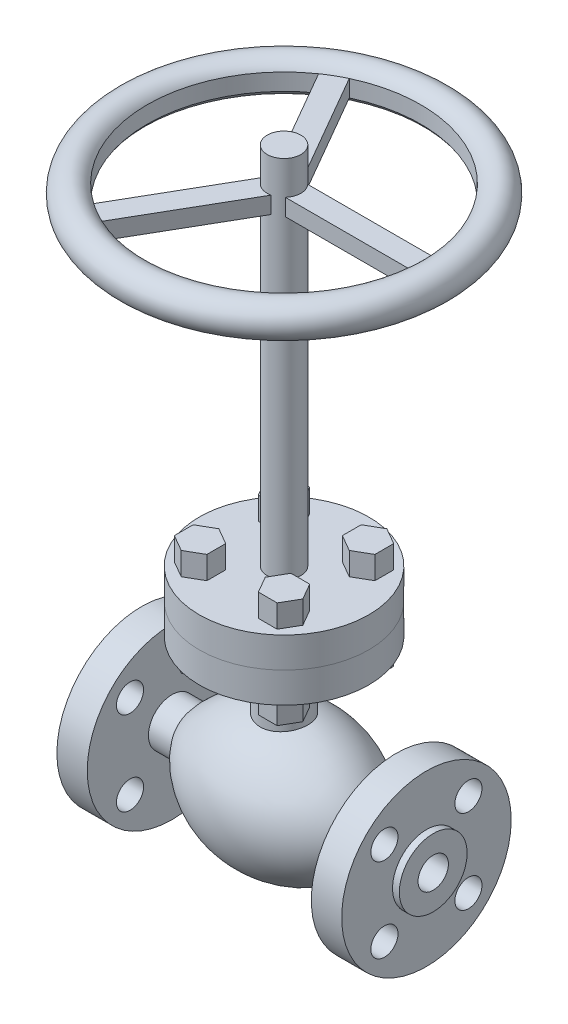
ISO-10303-21;
HEADER;
FILE_DESCRIPTION(('STEP AP214'),'2;1');
FILE_NAME('part.step','',(''),(''),'','','');
FILE_SCHEMA(('AUTOMOTIVE_DESIGN { 1 0 10303 214 1 1 1 1 }'));
ENDSEC;
DATA;
#1=APPLICATION_CONTEXT('core data for automotive mechanical design processes');
#2=APPLICATION_PROTOCOL_DEFINITION('international standard','automotive_design',2000,#1);
#3=PRODUCT_CONTEXT('',#1,'mechanical');
#4=PRODUCT('Part','Part','',(#3));
#5=PRODUCT_RELATED_PRODUCT_CATEGORY('part','',(#4));
#6=PRODUCT_DEFINITION_FORMATION('','',#4);
#7=PRODUCT_DEFINITION_CONTEXT('part definition',#1,'design');
#8=PRODUCT_DEFINITION('design','',#6,#7);
#9=PRODUCT_DEFINITION_SHAPE('','',#8);
#10=(LENGTH_UNIT() NAMED_UNIT(*) SI_UNIT(.MILLI.,.METRE.));
#11=(NAMED_UNIT(*) PLANE_ANGLE_UNIT() SI_UNIT($,.RADIAN.));
#12=(NAMED_UNIT(*) SI_UNIT($,.STERADIAN.) SOLID_ANGLE_UNIT());
#13=UNCERTAINTY_MEASURE_WITH_UNIT(LENGTH_MEASURE(1.E-05),#10,'distance_accuracy_value','');
#14=(GEOMETRIC_REPRESENTATION_CONTEXT(3) GLOBAL_UNCERTAINTY_ASSIGNED_CONTEXT((#13)) GLOBAL_UNIT_ASSIGNED_CONTEXT((#10,
#11,#12)) REPRESENTATION_CONTEXT('',''));
#15=CARTESIAN_POINT('',(0.,0.,0.));
#16=DIRECTION('',(0.,0.,1.));
#17=DIRECTION('',(1.,0.,0.));
#18=AXIS2_PLACEMENT_3D('',#15,#16,#17);
#19=CARTESIAN_POINT('',(0.,150.495,0.));
#20=DIRECTION('',(0.,-1.,0.));
#21=DIRECTION('',(0.,0.,-1.));
#22=AXIS2_PLACEMENT_3D('',#19,#20,#21);
#23=CYLINDRICAL_SURFACE('',#22,79.375);
#24=CARTESIAN_POINT('',(0.,178.943,0.));
#25=DIRECTION('',(0.,1.,0.));
#26=DIRECTION('',(0.,0.,1.));
#27=AXIS2_PLACEMENT_3D('',#24,#25,#26);
#28=CIRCLE('',#27,79.375);
#29=CARTESIAN_POINT('',(0.,178.943,79.375));
#30=VERTEX_POINT('',#29);
#31=EDGE_CURVE('E829',#30,#30,#28,.T.);
#32=ORIENTED_EDGE('',*,*,#31,.F.);
#33=EDGE_LOOP('',(#32));
#34=FACE_BOUND('',#33,.T.);
#35=CARTESIAN_POINT('',(0.,150.495,0.));
#36=DIRECTION('',(0.,-1.,0.));
#37=DIRECTION('',(0.,0.,-1.));
#38=AXIS2_PLACEMENT_3D('',#35,#36,#37);
#39=CIRCLE('',#38,79.375);
#40=CARTESIAN_POINT('',(79.375,150.495,0.));
#41=VERTEX_POINT('',#40);
#42=CARTESIAN_POINT('',(-79.375,150.495,0.));
#43=VERTEX_POINT('',#42);
#44=EDGE_CURVE('E13',#41,#43,#39,.T.);
#45=ORIENTED_EDGE('',*,*,#44,.F.);
#46=EDGE_CURVE('E44',#43,#41,#39,.T.);
#47=ORIENTED_EDGE('',*,*,#46,.F.);
#48=EDGE_LOOP('',(#45,#47));
#49=FACE_BOUND('',#48,.T.);
#50=ADVANCED_FACE('F40',(#34,#49),#23,.T.);
#51=CARTESIAN_POINT('',(139.7,22.098,0.));
#52=DIRECTION('',(-1.,0.,0.));
#53=DIRECTION('',(0.,0.,1.));
#54=AXIS2_PLACEMENT_3D('',#51,#52,#53);
#55=PLANE('',#54);
#56=CARTESIAN_POINT('',(139.7,0.,0.));
#57=DIRECTION('',(1.,0.,0.));
#58=DIRECTION('',(0.,0.,-1.));
#59=AXIS2_PLACEMENT_3D('',#56,#57,#58);
#60=CIRCLE('',#59,31.75);
#61=CARTESIAN_POINT('',(139.7,0.,-31.75));
#62=VERTEX_POINT('',#61);
#63=EDGE_CURVE('E897',#62,#62,#60,.T.);
#64=ORIENTED_EDGE('',*,*,#63,.T.);
#65=EDGE_LOOP('',(#64));
#66=FACE_BOUND('',#65,.T.);
#67=CARTESIAN_POINT('',(139.7,0.,0.));
#68=DIRECTION('',(-1.,0.,0.));
#69=DIRECTION('',(0.,0.,1.));
#70=AXIS2_PLACEMENT_3D('',#67,#68,#69);
#71=CIRCLE('',#70,14.224);
#72=CARTESIAN_POINT('',(139.7,0.,14.224));
#73=VERTEX_POINT('',#72);
#74=EDGE_CURVE('E736',#73,#73,#71,.T.);
#75=ORIENTED_EDGE('',*,*,#74,.T.);
#76=EDGE_LOOP('',(#75));
#77=FACE_BOUND('',#76,.T.);
#78=ADVANCED_FACE('F1010',(#66,#77),#55,.F.);
#79=CARTESIAN_POINT('',(-139.7,22.098,0.));
#80=DIRECTION('',(1.,0.,0.));
#81=DIRECTION('',(0.,0.,-1.));
#82=AXIS2_PLACEMENT_3D('',#79,#80,#81);
#83=PLANE('',#82);
#84=CARTESIAN_POINT('',(-139.7,0.,0.));
#85=DIRECTION('',(1.,0.,0.));
#86=DIRECTION('',(0.,0.,-1.));
#87=AXIS2_PLACEMENT_3D('',#84,#85,#86);
#88=CIRCLE('',#87,31.75);
#89=CARTESIAN_POINT('',(-139.7,0.,-31.75));
#90=VERTEX_POINT('',#89);
#91=EDGE_CURVE('E861',#90,#90,#88,.T.);
#92=ORIENTED_EDGE('',*,*,#91,.F.);
#93=EDGE_LOOP('',(#92));
#94=FACE_BOUND('',#93,.T.);
#95=CARTESIAN_POINT('',(-139.7,0.,0.));
#96=DIRECTION('',(1.,0.,0.));
#97=DIRECTION('',(0.,0.,-1.));
#98=AXIS2_PLACEMENT_3D('',#95,#96,#97);
#99=CIRCLE('',#98,14.224);
#100=CARTESIAN_POINT('',(-139.7,0.,-14.224));
#101=VERTEX_POINT('',#100);
#102=EDGE_CURVE('E739',#101,#101,#99,.F.);
#103=ORIENTED_EDGE('',*,*,#102,.F.);
#104=EDGE_LOOP('',(#103));
#105=FACE_BOUND('',#104,.T.);
#106=ADVANCED_FACE('F42',(#94,#105),#83,.F.);
#107=CARTESIAN_POINT('',(-128.093831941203,473.202,0.));
#108=DIRECTION('',(0.,1.,0.));
#109=DIRECTION('',(0.,0.,1.));
#110=AXIS2_PLACEMENT_3D('',#107,#108,#109);
#111=PLANE('',#110);
#112=CARTESIAN_POINT('',(0.,473.202,0.));
#113=DIRECTION('',(0.,-1.,0.));
#114=DIRECTION('',(0.,0.,-1.));
#115=AXIS2_PLACEMENT_3D('',#112,#113,#114);
#116=CIRCLE('',#115,128.093831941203);
#117=CARTESIAN_POINT('',(-54.7393217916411,473.202,115.808619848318));
#118=VERTEX_POINT('',#117);
#119=CARTESIAN_POINT('',(-72.9235458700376,473.202,105.309953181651));
#120=VERTEX_POINT('',#119);
#121=EDGE_CURVE('E825',#118,#120,#116,.T.);
#122=ORIENTED_EDGE('',*,*,#121,.T.);
#123=DIRECTION('',(-0.5,0.,0.866025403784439));
#124=VECTOR('',#123,1.);
#125=CARTESIAN_POINT('',(-72.9235458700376,473.202,105.309953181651));
#126=LINE('',#125,#124);
#127=CARTESIAN_POINT('',(-14.9610451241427,473.202,4.91595695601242));
#128=VERTEX_POINT('',#127);
#129=EDGE_CURVE('E742',#128,#120,#126,.T.);
#130=ORIENTED_EDGE('',*,*,#129,.F.);
#131=CARTESIAN_POINT('',(0.,473.202,0.));
#132=DIRECTION('',(0.,1.,0.));
#133=DIRECTION('',(0.,0.,1.));
#134=AXIS2_PLACEMENT_3D('',#131,#132,#133);
#135=CIRCLE('',#134,15.748);
#136=CARTESIAN_POINT('',(3.22317895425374,473.202,15.4146236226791));
#137=VERTEX_POINT('',#136);
#138=EDGE_CURVE('E2052',#137,#128,#135,.F.);
#139=ORIENTED_EDGE('',*,*,#138,.F.);
#140=DIRECTION('',(0.5,0.,-0.866025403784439));
#141=VECTOR('',#140,1.);
#142=CARTESIAN_POINT('',(-54.7393217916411,473.202,115.808619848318));
#143=LINE('',#142,#141);
#144=EDGE_CURVE('E770',#118,#137,#143,.T.);
#145=ORIENTED_EDGE('',*,*,#144,.F.);
#146=EDGE_LOOP('',(#122,#130,#139,#145));
#147=FACE_BOUND('',#146,.T.);
#148=ADVANCED_FACE('F1077',(#147),#111,.F.);
#149=CARTESIAN_POINT('',(-128.093831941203,488.95,0.));
#150=DIRECTION('',(0.,-1.,0.));
#151=DIRECTION('',(0.,0.,-1.));
#152=AXIS2_PLACEMENT_3D('',#149,#150,#151);
#153=PLANE('',#152);
#154=CARTESIAN_POINT('',(0.,488.95,0.));
#155=DIRECTION('',(0.,-1.,0.));
#156=DIRECTION('',(0.,0.,-1.));
#157=AXIS2_PLACEMENT_3D('',#154,#155,#156);
#158=CIRCLE('',#157,15.748);
#159=CARTESIAN_POINT('',(-14.9610451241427,488.95,4.91595695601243));
#160=VERTEX_POINT('',#159);
#161=CARTESIAN_POINT('',(3.22317895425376,488.95,15.4146236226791));
#162=VERTEX_POINT('',#161);
#163=EDGE_CURVE('E2047',#160,#162,#158,.F.);
#164=ORIENTED_EDGE('',*,*,#163,.F.);
#165=DIRECTION('',(0.5,0.,-0.866025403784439));
#166=VECTOR('',#165,1.);
#167=CARTESIAN_POINT('',(-72.9235458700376,488.95,105.309953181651));
#168=LINE('',#167,#166);
#169=CARTESIAN_POINT('',(-72.9235458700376,488.95,105.309953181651));
#170=VERTEX_POINT('',#169);
#171=EDGE_CURVE('E752',#170,#160,#168,.T.);
#172=ORIENTED_EDGE('',*,*,#171,.F.);
#173=CARTESIAN_POINT('',(0.,488.95,0.));
#174=DIRECTION('',(0.,-1.,0.));
#175=DIRECTION('',(0.,0.,-1.));
#176=AXIS2_PLACEMENT_3D('',#173,#174,#175);
#177=CIRCLE('',#176,128.093831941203);
#178=CARTESIAN_POINT('',(-54.7393217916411,488.95,115.808619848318));
#179=VERTEX_POINT('',#178);
#180=EDGE_CURVE('E820',#179,#170,#177,.T.);
#181=ORIENTED_EDGE('',*,*,#180,.F.);
#182=DIRECTION('',(-0.5,0.,0.866025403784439));
#183=VECTOR('',#182,1.);
#184=CARTESIAN_POINT('',(-54.7393217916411,488.95,115.808619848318));
#185=LINE('',#184,#183);
#186=EDGE_CURVE('E764',#162,#179,#185,.T.);
#187=ORIENTED_EDGE('',*,*,#186,.F.);
#188=EDGE_LOOP('',(#164,#172,#181,#187));
#189=FACE_BOUND('',#188,.T.);
#190=ADVANCED_FACE('F1052',(#189),#153,.F.);
#191=CARTESIAN_POINT('',(127.662867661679,473.202,-10.4986666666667));
#192=VERTEX_POINT('',#191);
#193=CARTESIAN_POINT('',(127.662867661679,473.202,10.4986666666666));
#194=VERTEX_POINT('',#193);
#195=EDGE_CURVE('E821',#192,#194,#116,.T.);
#196=ORIENTED_EDGE('',*,*,#195,.T.);
#197=DIRECTION('',(1.,0.,0.));
#198=VECTOR('',#197,1.);
#199=CARTESIAN_POINT('',(127.662867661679,473.202,10.4986666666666));
#200=LINE('',#199,#198);
#201=CARTESIAN_POINT('',(11.7378661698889,473.202,10.4986666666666));
#202=VERTEX_POINT('',#201);
#203=EDGE_CURVE('E767',#202,#194,#200,.T.);
#204=ORIENTED_EDGE('',*,*,#203,.F.);
#205=CARTESIAN_POINT('',(11.7378661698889,473.202,-10.4986666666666));
#206=VERTEX_POINT('',#205);
#207=EDGE_CURVE('E830',#206,#202,#135,.F.);
#208=ORIENTED_EDGE('',*,*,#207,.F.);
#209=DIRECTION('',(-1.,0.,0.));
#210=VECTOR('',#209,1.);
#211=CARTESIAN_POINT('',(127.662867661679,473.202,-10.4986666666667));
#212=LINE('',#211,#210);
#213=EDGE_CURVE('E790',#192,#206,#212,.T.);
#214=ORIENTED_EDGE('',*,*,#213,.F.);
#215=EDGE_LOOP('',(#196,#204,#208,#214));
#216=FACE_BOUND('',#215,.T.);
#217=ADVANCED_FACE('F1048',(#216),#111,.F.);
#218=CARTESIAN_POINT('',(11.7378661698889,488.95,10.4986666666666));
#219=VERTEX_POINT('',#218);
#220=CARTESIAN_POINT('',(11.7378661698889,488.95,-10.4986666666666));
#221=VERTEX_POINT('',#220);
#222=EDGE_CURVE('E824',#219,#221,#158,.F.);
#223=ORIENTED_EDGE('',*,*,#222,.F.);
#224=DIRECTION('',(-1.,0.,0.));
#225=VECTOR('',#224,1.);
#226=CARTESIAN_POINT('',(127.662867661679,488.95,10.4986666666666));
#227=LINE('',#226,#225);
#228=CARTESIAN_POINT('',(127.662867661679,488.95,10.4986666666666));
#229=VERTEX_POINT('',#228);
#230=EDGE_CURVE('E776',#229,#219,#227,.T.);
#231=ORIENTED_EDGE('',*,*,#230,.F.);
#232=CARTESIAN_POINT('',(127.662867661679,488.95,-10.4986666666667));
#233=VERTEX_POINT('',#232);
#234=EDGE_CURVE('E816',#233,#229,#177,.T.);
#235=ORIENTED_EDGE('',*,*,#234,.F.);
#236=DIRECTION('',(1.,0.,0.));
#237=VECTOR('',#236,1.);
#238=CARTESIAN_POINT('',(127.662867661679,488.95,-10.4986666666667));
#239=LINE('',#238,#237);
#240=EDGE_CURVE('E800',#221,#233,#239,.T.);
#241=ORIENTED_EDGE('',*,*,#240,.F.);
#242=EDGE_LOOP('',(#223,#231,#235,#241));
#243=FACE_BOUND('',#242,.T.);
#244=ADVANCED_FACE('F1043',(#243),#153,.F.);
#245=CARTESIAN_POINT('',(0.,0.,0.));
#246=DIRECTION('',(-1.,0.,0.));
#247=DIRECTION('',(0.,0.,1.));
#248=AXIS2_PLACEMENT_3D('',#245,#246,#247);
#249=DEGENERATE_TOROIDAL_SURFACE('',#248,42.0494662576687,105.549466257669,.F.);
#250=CARTESIAN_POINT('',(83.82,0.,0.));
#251=DIRECTION('',(-1.,0.,0.));
#252=DIRECTION('',(0.,0.,1.));
#253=AXIS2_PLACEMENT_3D('',#250,#251,#252);
#254=CIRCLE('',#253,22.098);
#255=CARTESIAN_POINT('',(83.82,0.,22.098));
#256=VERTEX_POINT('',#255);
#257=EDGE_CURVE('E907',#256,#256,#254,.T.);
#258=ORIENTED_EDGE('',*,*,#257,.T.);
#259=EDGE_LOOP('',(#258));
#260=FACE_BOUND('',#259,.T.);
#261=CARTESIAN_POINT('',(-83.82,0.,0.));
#262=DIRECTION('',(-1.,0.,0.));
#263=DIRECTION('',(0.,0.,1.));
#264=AXIS2_PLACEMENT_3D('',#261,#262,#263);
#265=CIRCLE('',#264,22.098);
#266=CARTESIAN_POINT('',(-83.82,0.,22.098));
#267=VERTEX_POINT('',#266);
#268=EDGE_CURVE('E910',#267,#267,#265,.T.);
#269=ORIENTED_EDGE('',*,*,#268,.F.);
#270=EDGE_LOOP('',(#269));
#271=FACE_BOUND('',#270,.T.);
#272=CARTESIAN_POINT('',(-15.5922886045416,60.2619520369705,-15.9692643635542));
#273=CARTESIAN_POINT('',(-16.040371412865,60.308651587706,-15.5317695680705));
#274=CARTESIAN_POINT('',(-16.4699378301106,60.3554268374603,-15.0754864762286));
#275=CARTESIAN_POINT('',(-17.2893765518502,60.4478459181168,-14.1282147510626));
#276=CARTESIAN_POINT('',(-17.6792405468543,60.4934895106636,-13.6372188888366));
#277=CARTESIAN_POINT('',(-18.4167039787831,60.5823855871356,-12.6235934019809));
#278=CARTESIAN_POINT('',(-18.7642656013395,60.6256359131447,-12.1009360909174));
#279=CARTESIAN_POINT('',(-19.4142462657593,60.7084799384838,-11.0280220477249));
#280=CARTESIAN_POINT('',(-19.7166677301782,60.7480738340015,-10.4777667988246));
#281=CARTESIAN_POINT('',(-20.2742013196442,60.8224857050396,-9.35346779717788));
#282=CARTESIAN_POINT('',(-20.5293128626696,60.857303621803,-8.77942375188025));
#283=CARTESIAN_POINT('',(-20.9903476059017,60.921172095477,-7.61158803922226));
#284=CARTESIAN_POINT('',(-21.1962701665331,60.950222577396,-7.01779611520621));
#285=CARTESIAN_POINT('',(-21.5573345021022,61.0017177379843,-5.81484822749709));
#286=CARTESIAN_POINT('',(-21.7124889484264,61.0241640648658,-5.20569613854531));
#287=CARTESIAN_POINT('',(-21.970906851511,61.0618152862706,-3.97626467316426));
#288=CARTESIAN_POINT('',(-22.0741708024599,61.0770202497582,-3.355985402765));
#289=CARTESIAN_POINT('',(-22.2274813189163,61.0996715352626,-2.11311975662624));
#290=CARTESIAN_POINT('',(-22.2778923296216,61.1071709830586,-1.49057928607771));
#291=CARTESIAN_POINT('',(-22.3263756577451,61.1143827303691,-0.243419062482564));
#292=CARTESIAN_POINT('',(-22.3244481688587,61.1140950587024,0.381200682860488));
#293=CARTESIAN_POINT('',(-22.2682693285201,61.1057407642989,1.62803279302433));
#294=CARTESIAN_POINT('',(-22.2140176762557,61.0976740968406,2.25024514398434));
#295=CARTESIAN_POINT('',(-22.053604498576,61.0739918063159,3.48779458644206));
#296=CARTESIAN_POINT('',(-21.9474430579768,61.0583761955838,4.10313168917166));
#297=CARTESIAN_POINT('',(-21.6846766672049,61.0201365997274,5.31947999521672));
#298=CARTESIAN_POINT('',(-21.5283272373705,60.9975481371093,5.92054754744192));
#299=CARTESIAN_POINT('',(-21.1661955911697,60.9459716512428,7.1073146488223));
#300=CARTESIAN_POINT('',(-20.960413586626,60.9169836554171,7.69301426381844));
#301=CARTESIAN_POINT('',(-20.5009119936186,60.8534163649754,8.84500115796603));
#302=CARTESIAN_POINT('',(-20.2471908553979,60.8188368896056,9.41128780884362));
#303=CARTESIAN_POINT('',(-19.6936362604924,60.7450478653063,10.5205410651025));
#304=CARTESIAN_POINT('',(-19.3938024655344,60.7058382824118,11.063507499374));
#305=CARTESIAN_POINT('',(-18.7478770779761,60.6235852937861,12.1261404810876));
#306=CARTESIAN_POINT('',(-18.4014754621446,60.580516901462,12.6456166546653));
#307=CARTESIAN_POINT('',(-17.6664949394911,60.4919873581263,13.6536035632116));
#308=CARTESIAN_POINT('',(-17.2779158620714,60.446526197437,14.1421141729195));
#309=CARTESIAN_POINT('',(-16.4612606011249,60.3544760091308,15.0848501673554));
#310=CARTESIAN_POINT('',(-16.033182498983,60.3078869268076,15.539073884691));
#311=CARTESIAN_POINT('',(-15.1404908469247,60.2148809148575,16.4100976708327));
#312=CARTESIAN_POINT('',(-14.6758771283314,60.1684639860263,16.8268975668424));
#313=CARTESIAN_POINT('',(-13.7093056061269,60.0767187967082,17.6234856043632));
#314=CARTESIAN_POINT('',(-13.2070703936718,60.0314027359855,18.0029386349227));
#315=CARTESIAN_POINT('',(-12.1721829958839,59.9435519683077,18.7181856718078));
#316=CARTESIAN_POINT('',(-11.6395306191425,59.9010172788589,19.0539794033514));
#317=CARTESIAN_POINT('',(-10.5475397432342,59.8199467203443,19.6794865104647));
#318=CARTESIAN_POINT('',(-9.98820163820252,59.7814107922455,19.969200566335));
#319=CARTESIAN_POINT('',(-8.84677147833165,59.7094464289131,20.500433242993));
#320=CARTESIAN_POINT('',(-8.26467955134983,59.676017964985,20.7419521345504));
#321=CARTESIAN_POINT('',(-7.08381447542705,59.6153365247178,21.1742882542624));
#322=CARTESIAN_POINT('',(-6.48510218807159,59.5880636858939,21.3652689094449));
#323=CARTESIAN_POINT('',(-5.27345075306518,59.5403444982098,21.696128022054));
#324=CARTESIAN_POINT('',(-4.66051162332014,59.5198981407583,21.8360065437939));
#325=CARTESIAN_POINT('',(-3.42485745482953,59.486428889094,22.0635866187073));
#326=CARTESIAN_POINT('',(-2.80214298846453,59.4734055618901,22.1512912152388));
#327=CARTESIAN_POINT('',(-1.55142307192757,59.4551619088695,22.2738585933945));
#328=CARTESIAN_POINT('',(-0.923417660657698,59.4499415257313,22.3087217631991));
#329=CARTESIAN_POINT('',(0.327140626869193,59.4474686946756,22.3252559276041));
#330=CARTESIAN_POINT('',(0.949686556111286,59.4501385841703,22.3074453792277));
#331=CARTESIAN_POINT('',(2.19102999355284,59.463201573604,22.2198874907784));
#332=CARTESIAN_POINT('',(2.80982752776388,59.4735946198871,22.1501405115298));
#333=CARTESIAN_POINT('',(4.03926231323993,59.5018052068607,21.9592399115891));
#334=CARTESIAN_POINT('',(4.64989962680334,59.5196226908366,21.8380866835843));
#335=CARTESIAN_POINT('',(5.85869773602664,59.5621721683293,21.5452840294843));
#336=CARTESIAN_POINT('',(6.45685850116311,59.5869041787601,21.3736344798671));
#337=CARTESIAN_POINT('',(7.63590860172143,59.6425503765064,20.9813107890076));
#338=CARTESIAN_POINT('',(8.21681474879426,59.6734583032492,20.7606862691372));
#339=CARTESIAN_POINT('',(9.35795652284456,59.7405991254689,20.2719213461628));
#340=CARTESIAN_POINT('',(9.91819218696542,59.7768320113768,20.0037810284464));
#341=CARTESIAN_POINT('',(11.0141757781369,59.8536085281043,19.4218888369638));
#342=CARTESIAN_POINT('',(11.5499224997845,59.8941523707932,19.1081347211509));
#343=CARTESIAN_POINT('',(12.5932544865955,59.9784195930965,18.4372308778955));
#344=CARTESIAN_POINT('',(13.1008395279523,60.0221429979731,18.0800808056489));
#345=CARTESIAN_POINT('',(14.0890101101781,60.1119757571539,17.3213257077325));
#346=CARTESIAN_POINT('',(14.5692988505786,60.15810359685,16.9193362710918));
#347=CARTESIAN_POINT('',(15.494373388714,60.2510668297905,16.0764677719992));
#348=CARTESIAN_POINT('',(15.939158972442,60.2979022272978,15.6355884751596));
#349=CARTESIAN_POINT('',(16.7901669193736,60.3909679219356,14.7179730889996));
#350=CARTESIAN_POINT('',(17.1963879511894,60.4371981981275,14.241235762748));
#351=CARTESIAN_POINT('',(17.9674193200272,60.5277550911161,13.2552027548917));
#352=CARTESIAN_POINT('',(18.3322296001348,60.5720817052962,12.7459070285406));
#353=CARTESIAN_POINT('',(19.0196684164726,60.6578103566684,11.6955167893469));
#354=CARTESIAN_POINT('',(19.3420654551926,60.699195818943,11.1542693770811));
#355=CARTESIAN_POINT('',(19.9400809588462,60.7776054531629,10.0462128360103));
#356=CARTESIAN_POINT('',(20.2156992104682,60.8146296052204,9.47940359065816));
#357=CARTESIAN_POINT('',(20.7181170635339,60.8832557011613,8.32425216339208));
#358=CARTESIAN_POINT('',(20.9449185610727,60.9148578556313,7.73591081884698));
#359=CARTESIAN_POINT('',(21.3480156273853,60.9717326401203,6.54187579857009));
#360=CARTESIAN_POINT('',(21.5243115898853,60.9970053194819,5.93618225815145));
#361=CARTESIAN_POINT('',(21.824013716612,61.040340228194,4.71605624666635));
#362=CARTESIAN_POINT('',(21.9477782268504,61.0584512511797,4.10171352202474));
#363=CARTESIAN_POINT('',(22.143236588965,61.0871930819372,2.8646259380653));
#364=CARTESIAN_POINT('',(22.2149306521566,61.0978239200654,2.24188111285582));
#365=CARTESIAN_POINT('',(22.3056955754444,61.1112998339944,0.992514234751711));
#366=CARTESIAN_POINT('',(22.3247689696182,61.1141452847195,0.365892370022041));
#367=CARTESIAN_POINT('',(22.3101524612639,61.1119696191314,-0.886720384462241));
#368=CARTESIAN_POINT('',(22.2764628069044,61.1069485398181,-1.51271127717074));
#369=CARTESIAN_POINT('',(22.1570775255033,61.0892580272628,-2.75437123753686));
#370=CARTESIAN_POINT('',(22.0718143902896,61.0766522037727,-3.37008285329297));
#371=CARTESIAN_POINT('',(21.850294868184,61.0442019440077,-4.59206454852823));
#372=CARTESIAN_POINT('',(21.7140388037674,61.0243575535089,-5.1983346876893));
#373=CARTESIAN_POINT('',(21.3915477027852,60.9779878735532,-6.39717672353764));
#374=CARTESIAN_POINT('',(21.2053120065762,60.9514624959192,-6.98974843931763));
#375=CARTESIAN_POINT('',(20.7842317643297,60.8924735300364,-8.15705607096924));
#376=CARTESIAN_POINT('',(20.5493869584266,60.8600099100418,-8.73179189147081));
#377=CARTESIAN_POINT('',(20.0319611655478,60.7899368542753,-9.86126222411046));
#378=CARTESIAN_POINT('',(19.7492299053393,60.7523112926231,-10.4159268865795));
#379=CARTESIAN_POINT('',(19.1385809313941,60.6730437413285,-11.4994932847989));
#380=CARTESIAN_POINT('',(18.8106631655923,60.6314017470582,-12.0283949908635));
#381=CARTESIAN_POINT('',(18.1119289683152,60.545255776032,-13.056852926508));
#382=CARTESIAN_POINT('',(17.7411101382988,60.5007516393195,-13.5564075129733));
#383=CARTESIAN_POINT('',(16.959159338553,60.4101162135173,-14.5227443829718));
#384=CARTESIAN_POINT('',(16.5480270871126,60.3639849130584,-14.9895264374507));
#385=CARTESIAN_POINT('',(15.6840743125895,60.2709198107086,-15.8915219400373));
#386=CARTESIAN_POINT('',(15.2308864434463,60.2239825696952,-16.3263832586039));
#387=CARTESIAN_POINT('',(14.2894270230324,60.1310753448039,-17.1564267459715));
#388=CARTESIAN_POINT('',(13.8011552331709,60.0851053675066,-17.5516086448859));
#389=CARTESIAN_POINT('',(12.7929047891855,59.9954333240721,-18.2995202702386));
#390=CARTESIAN_POINT('',(12.2729256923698,59.9517312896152,-18.6522494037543));
#391=CARTESIAN_POINT('',(11.204879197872,59.8678384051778,-19.3127364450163));
#392=CARTESIAN_POINT('',(10.6568118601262,59.8276475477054,-19.6204944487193));
#393=CARTESIAN_POINT('',(9.53568171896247,59.7518765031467,-20.189186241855));
#394=CARTESIAN_POINT('',(8.96258708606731,59.7163024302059,-20.4500581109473));
#395=CARTESIAN_POINT('',(7.79612361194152,59.6508535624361,-20.9225546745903));
#396=CARTESIAN_POINT('',(7.20275472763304,59.6209787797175,-21.1341792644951));
#397=CARTESIAN_POINT('',(6.00003258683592,59.567798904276,-21.5065744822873));
#398=CARTESIAN_POINT('',(5.39068068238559,59.5444932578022,-21.6673493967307));
#399=CARTESIAN_POINT('',(4.16034311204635,59.5051298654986,-21.9368409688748));
#400=CARTESIAN_POINT('',(3.5393575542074,59.4890720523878,-22.0455581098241));
#401=CARTESIAN_POINT('',(2.296107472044,59.4647896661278,-22.209326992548));
#402=CARTESIAN_POINT('',(1.67390911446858,59.4564933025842,-22.2648706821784));
#403=CARTESIAN_POINT('',(0.426990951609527,59.4477158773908,-22.3236221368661));
#404=CARTESIAN_POINT('',(-0.197728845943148,59.4472347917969,-22.326830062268));
#405=CARTESIAN_POINT('',(-1.44529958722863,59.4541024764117,-22.2808814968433));
#406=CARTESIAN_POINT('',(-2.06815020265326,59.4614525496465,-22.2317162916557));
#407=CARTESIAN_POINT('',(-3.30739626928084,59.48377167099,-22.0813853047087));
#408=CARTESIAN_POINT('',(-3.92379180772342,59.4987406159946,-21.9802202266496));
#409=CARTESIAN_POINT('',(-5.14266640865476,59.5357722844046,-21.7272942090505));
#410=CARTESIAN_POINT('',(-5.74519973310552,59.5577990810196,-21.5757893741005));
#411=CARTESIAN_POINT('',(-6.93531872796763,59.6083419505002,-21.2231816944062));
#412=CARTESIAN_POINT('',(-7.52290370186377,59.6368583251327,-21.0220765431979));
#413=CARTESIAN_POINT('',(-8.67854920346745,59.6995495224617,-20.5719181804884));
#414=CARTESIAN_POINT('',(-9.24662550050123,59.7337196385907,-20.3229048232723));
#415=CARTESIAN_POINT('',(-10.3596901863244,59.8067628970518,-19.778714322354));
#416=CARTESIAN_POINT('',(-10.9046830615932,59.8456351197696,-19.4835462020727));
#417=CARTESIAN_POINT('',(-12.1887767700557,59.9439108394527,-18.7173079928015));
#418=CARTESIAN_POINT('',(-12.9146376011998,60.0051430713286,-18.2240561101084));
#419=CARTESIAN_POINT('',(-14.3031603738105,60.1315181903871,-17.1558668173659));
#420=CARTESIAN_POINT('',(-14.9658214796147,60.1966611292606,-16.5809283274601));
#421=CARTESIAN_POINT('',(-15.5922886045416,60.2619520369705,-15.9692643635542));
#422=B_SPLINE_CURVE_WITH_KNOTS('',3,(#272,#273,#274,#275,#276,#277,#278,#279,#280,#281,#282,
#283,#284,#285,#286,#287,#288,#289,#290,#291,#292,#293,#294,#295,#296,#297,#298,#299,#300,#301,
#302,#303,#304,#305,#306,#307,#308,#309,#310,#311,#312,#313,#314,#315,#316,#317,#318,#319,#320,
#321,#322,#323,#324,#325,#326,#327,#328,#329,#330,#331,#332,#333,#334,#335,#336,#337,#338,#339,
#340,#341,#342,#343,#344,#345,#346,#347,#348,#349,#350,#351,#352,#353,#354,#355,#356,#357,#358,
#359,#360,#361,#362,#363,#364,#365,#366,#367,#368,#369,#370,#371,#372,#373,#374,#375,#376,#377,
#378,#379,#380,#381,#382,#383,#384,#385,#386,#387,#388,#389,#390,#391,#392,#393,#394,#395,#396,
#397,#398,#399,#400,#401,#402,#403,#404,#405,#406,#407,#408,#409,#410,#411,#412,#413,#414,#415,
#416,#417,#418,#419,#420,#421),.UNSPECIFIED.,.T.,.F.,(4,2,2,2,2,2,2,2,2,2,2,2,2,2,2,2,2,2,2,2,2,
2,2,2,2,2,2,2,2,2,2,2,2,2,2,2,2,2,2,2,2,2,2,2,2,2,2,2,2,2,2,2,2,2,2,2,2,2,2,2,2,2,2,2,2,2,2,2,2,
2,2,2,2,2,4),(0.,1.88318963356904,3.76677260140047,5.65202713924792,7.53718046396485,
9.42235697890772,11.3075580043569,13.1922881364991,15.0770003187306,16.9486293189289,
18.8202513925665,20.6918842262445,22.5635140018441,24.4257620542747,26.2880021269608,
28.1503024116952,30.0126163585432,31.8880068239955,33.7634048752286,35.63889406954,
37.5143919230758,39.4054222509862,41.2964644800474,43.1874787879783,45.0784824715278,
46.9632942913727,48.8481037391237,50.7328032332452,52.6174888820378,54.4836858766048,
56.3498699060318,58.2160396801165,60.0822140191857,61.9465061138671,63.8107948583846,
65.6751752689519,67.539570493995,69.4213968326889,71.3032345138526,73.1851371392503,
75.0670423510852,76.958827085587,78.8506204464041,80.7423403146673,82.634045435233,
84.5126303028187,86.3912075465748,88.2696943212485,90.1481722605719,92.0111116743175,
93.8740393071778,95.7369915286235,97.5999537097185,99.4688742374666,101.337796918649,
103.20682413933,105.07586442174,106.963126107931,108.850400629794,110.737701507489,
112.624998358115,114.514769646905,116.404544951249,118.29416090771,120.183759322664,
122.055701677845,123.927638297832,125.79988643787,127.672109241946,129.534949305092,
131.397876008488,133.259259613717,135.120279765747,137.753143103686,140.38604125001),.UNSPECIFIED.);
#423=CARTESIAN_POINT('',(-15.5922886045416,60.2619520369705,-15.9692643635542));
#424=VERTEX_POINT('',#423);
#425=EDGE_CURVE('E921',#424,#424,#422,.T.);
#426=ORIENTED_EDGE('',*,*,#425,.F.);
#427=EDGE_LOOP('',(#426));
#428=FACE_BOUND('',#427,.T.);
#429=ADVANCED_FACE('F932',(#260,#271,#428),#249,.F.);
#430=CARTESIAN_POINT('',(-104.902,0.,0.));
#431=DIRECTION('',(-1.,0.,0.));
#432=DIRECTION('',(0.,0.,-1.));
#433=AXIS2_PLACEMENT_3D('',#430,#431,#432);
#434=PLANE('',#433);
#435=CARTESIAN_POINT('',(-104.902,-39.3335218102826,-39.3335218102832));
#436=DIRECTION('',(1.,0.,0.));
#437=DIRECTION('',(0.,-1.,0.));
#438=AXIS2_PLACEMENT_3D('',#435,#436,#437);
#439=CIRCLE('',#438,12.7);
#440=CARTESIAN_POINT('',(-104.902,-52.0335218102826,-39.3335218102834));
#441=VERTEX_POINT('',#440);
#442=EDGE_CURVE('E842',#441,#441,#439,.F.);
#443=ORIENTED_EDGE('',*,*,#442,.T.);
#444=EDGE_LOOP('',(#443));
#445=FACE_BOUND('',#444,.T.);
#446=CARTESIAN_POINT('',(-104.902,-39.3335218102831,39.3335218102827));
#447=DIRECTION('',(1.,0.,0.));
#448=DIRECTION('',(0.,0.,1.));
#449=AXIS2_PLACEMENT_3D('',#446,#447,#448);
#450=CIRCLE('',#449,12.7);
#451=CARTESIAN_POINT('',(-104.902,-39.3335218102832,52.0335218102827));
#452=VERTEX_POINT('',#451);
#453=EDGE_CURVE('E848',#452,#452,#450,.F.);
#454=ORIENTED_EDGE('',*,*,#453,.T.);
#455=EDGE_LOOP('',(#454));
#456=FACE_BOUND('',#455,.T.);
#457=CARTESIAN_POINT('',(-104.902,39.3335218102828,39.3335218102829));
#458=DIRECTION('',(1.,0.,0.));
#459=DIRECTION('',(0.,1.,0.));
#460=AXIS2_PLACEMENT_3D('',#457,#458,#459);
#461=CIRCLE('',#460,12.7);
#462=CARTESIAN_POINT('',(-104.902,52.0335218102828,39.333521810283));
#463=VERTEX_POINT('',#462);
#464=EDGE_CURVE('E854',#463,#463,#461,.F.);
#465=ORIENTED_EDGE('',*,*,#464,.T.);
#466=EDGE_LOOP('',(#465));
#467=FACE_BOUND('',#466,.T.);
#468=CARTESIAN_POINT('',(-104.902,0.,0.));
#469=DIRECTION('',(-1.,0.,0.));
#470=DIRECTION('',(0.,0.,1.));
#471=AXIS2_PLACEMENT_3D('',#468,#469,#470);
#472=CIRCLE('',#471,22.098);
#473=CARTESIAN_POINT('',(-104.902,0.,22.098));
#474=VERTEX_POINT('',#473);
#475=EDGE_CURVE('E916',#474,#474,#472,.T.);
#476=ORIENTED_EDGE('',*,*,#475,.T.);
#477=EDGE_LOOP('',(#476));
#478=FACE_BOUND('',#477,.T.);
#479=CARTESIAN_POINT('',(-104.902,0.,0.));
#480=DIRECTION('',(1.,0.,0.));
#481=DIRECTION('',(0.,0.,-1.));
#482=AXIS2_PLACEMENT_3D('',#479,#480,#481);
#483=CIRCLE('',#482,79.375);
#484=CARTESIAN_POINT('',(-104.902,0.,-79.375));
#485=VERTEX_POINT('',#484);
#486=EDGE_CURVE('E870',#485,#485,#483,.T.);
#487=ORIENTED_EDGE('',*,*,#486,.T.);
#488=EDGE_LOOP('',(#487));
#489=FACE_BOUND('',#488,.T.);
#490=CARTESIAN_POINT('',(-104.902,39.3335218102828,-39.333521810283));
#491=DIRECTION('',(-1.,0.,0.));
#492=DIRECTION('',(0.,0.,1.));
#493=AXIS2_PLACEMENT_3D('',#490,#491,#492);
#494=CIRCLE('',#493,12.7);
#495=CARTESIAN_POINT('',(-104.902,39.3335218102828,-26.633521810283));
#496=VERTEX_POINT('',#495);
#497=EDGE_CURVE('E857',#496,#496,#494,.T.);
#498=ORIENTED_EDGE('',*,*,#497,.T.);
#499=EDGE_LOOP('',(#498));
#500=FACE_BOUND('',#499,.T.);
#501=ADVANCED_FACE('F969',(#445,#456,#467,#478,#489,#500),#434,.F.);
#502=CARTESIAN_POINT('',(-133.35,0.,0.));
#503=DIRECTION('',(-1.,0.,0.));
#504=DIRECTION('',(0.,0.,1.));
#505=AXIS2_PLACEMENT_3D('',#502,#503,#504);
#506=PLANE('',#505);
#507=CARTESIAN_POINT('',(-133.35,-39.3335218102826,-39.3335218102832));
#508=DIRECTION('',(1.,0.,0.));
#509=DIRECTION('',(0.,-1.,0.));
#510=AXIS2_PLACEMENT_3D('',#507,#508,#509);
#511=CIRCLE('',#510,12.7);
#512=CARTESIAN_POINT('',(-133.35,-52.0335218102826,-39.3335218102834));
#513=VERTEX_POINT('',#512);
#514=EDGE_CURVE('E839',#513,#513,#511,.F.);
#515=ORIENTED_EDGE('',*,*,#514,.F.);
#516=EDGE_LOOP('',(#515));
#517=FACE_BOUND('',#516,.T.);
#518=CARTESIAN_POINT('',(-133.35,-39.3335218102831,39.3335218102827));
#519=DIRECTION('',(1.,0.,0.));
#520=DIRECTION('',(0.,0.,1.));
#521=AXIS2_PLACEMENT_3D('',#518,#519,#520);
#522=CIRCLE('',#521,12.7);
#523=CARTESIAN_POINT('',(-133.35,-39.3335218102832,52.0335218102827));
#524=VERTEX_POINT('',#523);
#525=EDGE_CURVE('E845',#524,#524,#522,.F.);
#526=ORIENTED_EDGE('',*,*,#525,.F.);
#527=EDGE_LOOP('',(#526));
#528=FACE_BOUND('',#527,.T.);
#529=CARTESIAN_POINT('',(-133.35,39.3335218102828,39.3335218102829));
#530=DIRECTION('',(1.,0.,0.));
#531=DIRECTION('',(0.,1.,0.));
#532=AXIS2_PLACEMENT_3D('',#529,#530,#531);
#533=CIRCLE('',#532,12.7);
#534=CARTESIAN_POINT('',(-133.35,52.0335218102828,39.333521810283));
#535=VERTEX_POINT('',#534);
#536=EDGE_CURVE('E851',#535,#535,#533,.F.);
#537=ORIENTED_EDGE('',*,*,#536,.F.);
#538=EDGE_LOOP('',(#537));
#539=FACE_BOUND('',#538,.T.);
#540=CARTESIAN_POINT('',(-133.35,0.,0.));
#541=DIRECTION('',(-1.,0.,0.));
#542=DIRECTION('',(0.,0.,1.));
#543=AXIS2_PLACEMENT_3D('',#540,#541,#542);
#544=CIRCLE('',#543,79.375);
#545=CARTESIAN_POINT('',(-133.35,0.,79.375));
#546=VERTEX_POINT('',#545);
#547=EDGE_CURVE('E867',#546,#546,#544,.T.);
#548=ORIENTED_EDGE('',*,*,#547,.T.);
#549=EDGE_LOOP('',(#548));
#550=FACE_BOUND('',#549,.T.);
#551=CARTESIAN_POINT('',(-133.35,0.,0.));
#552=DIRECTION('',(1.,0.,0.));
#553=DIRECTION('',(0.,0.,-1.));
#554=AXIS2_PLACEMENT_3D('',#551,#552,#553);
#555=CIRCLE('',#554,31.75);
#556=CARTESIAN_POINT('',(-133.35,0.,-31.75));
#557=VERTEX_POINT('',#556);
#558=EDGE_CURVE('E864',#557,#557,#555,.T.);
#559=ORIENTED_EDGE('',*,*,#558,.T.);
#560=EDGE_LOOP('',(#559));
#561=FACE_BOUND('',#560,.T.);
#562=CARTESIAN_POINT('',(-133.35,39.3335218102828,-39.333521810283));
#563=DIRECTION('',(-1.,0.,0.));
#564=DIRECTION('',(0.,0.,1.));
#565=AXIS2_PLACEMENT_3D('',#562,#563,#564);
#566=CIRCLE('',#565,12.7);
#567=CARTESIAN_POINT('',(-133.35,39.3335218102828,-26.633521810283));
#568=VERTEX_POINT('',#567);
#569=EDGE_CURVE('E858',#568,#568,#566,.T.);
#570=ORIENTED_EDGE('',*,*,#569,.F.);
#571=EDGE_LOOP('',(#570));
#572=FACE_BOUND('',#571,.T.);
#573=ADVANCED_FACE('F965',(#517,#528,#539,#550,#561,#572),#506,.T.);
#574=CARTESIAN_POINT('',(-104.902,0.,0.));
#575=DIRECTION('',(-1.,0.,0.));
#576=DIRECTION('',(0.,0.,1.));
#577=AXIS2_PLACEMENT_3D('',#574,#575,#576);
#578=CYLINDRICAL_SURFACE('',#577,79.375);
#579=ORIENTED_EDGE('',*,*,#486,.F.);
#580=EDGE_LOOP('',(#579));
#581=FACE_BOUND('',#580,.T.);
#582=ORIENTED_EDGE('',*,*,#547,.F.);
#583=EDGE_LOOP('',(#582));
#584=FACE_BOUND('',#583,.T.);
#585=ADVANCED_FACE('F968',(#581,#584),#578,.T.);
#586=CARTESIAN_POINT('',(-321.740364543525,0.,0.));
#587=DIRECTION('',(-1.,0.,0.));
#588=DIRECTION('',(0.,0.,1.));
#589=AXIS2_PLACEMENT_3D('',#586,#587,#588);
#590=CYLINDRICAL_SURFACE('',#589,22.098);
#591=ORIENTED_EDGE('',*,*,#268,.T.);
#592=EDGE_LOOP('',(#591));
#593=FACE_BOUND('',#592,.T.);
#594=ORIENTED_EDGE('',*,*,#475,.F.);
#595=EDGE_LOOP('',(#594));
#596=FACE_BOUND('',#595,.T.);
#597=ADVANCED_FACE('F976',(#593,#596),#590,.T.);
#598=CARTESIAN_POINT('',(104.902,0.,0.));
#599=DIRECTION('',(1.,0.,0.));
#600=DIRECTION('',(0.,0.,-1.));
#601=AXIS2_PLACEMENT_3D('',#598,#599,#600);
#602=CYLINDRICAL_SURFACE('',#601,79.375);
#603=CARTESIAN_POINT('',(104.902,0.,0.));
#604=DIRECTION('',(1.,0.,0.));
#605=DIRECTION('',(0.,0.,-1.));
#606=AXIS2_PLACEMENT_3D('',#603,#604,#605);
#607=CIRCLE('',#606,79.375);
#608=CARTESIAN_POINT('',(104.902,0.,-79.375));
#609=VERTEX_POINT('',#608);
#610=EDGE_CURVE('E904',#609,#609,#607,.T.);
#611=ORIENTED_EDGE('',*,*,#610,.T.);
#612=EDGE_LOOP('',(#611));
#613=FACE_BOUND('',#612,.T.);
#614=CARTESIAN_POINT('',(133.35,0.,0.));
#615=DIRECTION('',(1.,0.,0.));
#616=DIRECTION('',(0.,0.,-1.));
#617=AXIS2_PLACEMENT_3D('',#614,#615,#616);
#618=CIRCLE('',#617,79.375);
#619=CARTESIAN_POINT('',(133.35,0.,-79.375));
#620=VERTEX_POINT('',#619);
#621=EDGE_CURVE('E901',#620,#620,#618,.F.);
#622=ORIENTED_EDGE('',*,*,#621,.T.);
#623=EDGE_LOOP('',(#622));
#624=FACE_BOUND('',#623,.T.);
#625=ADVANCED_FACE('F1006',(#613,#624),#602,.T.);
#626=CARTESIAN_POINT('',(-321.740364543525,0.,0.));
#627=DIRECTION('',(-1.,0.,0.));
#628=DIRECTION('',(0.,0.,1.));
#629=AXIS2_PLACEMENT_3D('',#626,#627,#628);
#630=CYLINDRICAL_SURFACE('',#629,22.098);
#631=ORIENTED_EDGE('',*,*,#257,.F.);
#632=EDGE_LOOP('',(#631));
#633=FACE_BOUND('',#632,.T.);
#634=CARTESIAN_POINT('',(104.902,0.,0.));
#635=DIRECTION('',(1.,0.,0.));
#636=DIRECTION('',(0.,0.,-1.));
#637=AXIS2_PLACEMENT_3D('',#634,#635,#636);
#638=CIRCLE('',#637,22.098);
#639=CARTESIAN_POINT('',(104.902,0.,-22.098));
#640=VERTEX_POINT('',#639);
#641=EDGE_CURVE('E913',#640,#640,#638,.T.);
#642=ORIENTED_EDGE('',*,*,#641,.F.);
#643=EDGE_LOOP('',(#642));
#644=FACE_BOUND('',#643,.T.);
#645=ADVANCED_FACE('F1004',(#633,#644),#630,.T.);
#646=CARTESIAN_POINT('',(104.902,0.,0.));
#647=DIRECTION('',(1.,0.,0.));
#648=DIRECTION('',(0.,0.,-1.));
#649=AXIS2_PLACEMENT_3D('',#646,#647,#648);
#650=PLANE('',#649);
#651=CARTESIAN_POINT('',(104.902,-39.3335218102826,-39.3335218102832));
#652=DIRECTION('',(1.,0.,0.));
#653=DIRECTION('',(0.,-1.,0.));
#654=AXIS2_PLACEMENT_3D('',#651,#652,#653);
#655=CIRCLE('',#654,12.7);
#656=CARTESIAN_POINT('',(104.902,-52.0335218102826,-39.3335218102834));
#657=VERTEX_POINT('',#656);
#658=EDGE_CURVE('E876',#657,#657,#655,.F.);
#659=ORIENTED_EDGE('',*,*,#658,.F.);
#660=EDGE_LOOP('',(#659));
#661=FACE_BOUND('',#660,.T.);
#662=CARTESIAN_POINT('',(104.902,-39.3335218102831,39.3335218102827));
#663=DIRECTION('',(1.,0.,0.));
#664=DIRECTION('',(0.,0.,1.));
#665=AXIS2_PLACEMENT_3D('',#662,#663,#664);
#666=CIRCLE('',#665,12.7);
#667=CARTESIAN_POINT('',(104.902,-39.3335218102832,52.0335218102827));
#668=VERTEX_POINT('',#667);
#669=EDGE_CURVE('E882',#668,#668,#666,.F.);
#670=ORIENTED_EDGE('',*,*,#669,.F.);
#671=EDGE_LOOP('',(#670));
#672=FACE_BOUND('',#671,.T.);
#673=CARTESIAN_POINT('',(104.902,39.3335218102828,39.3335218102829));
#674=DIRECTION('',(1.,0.,0.));
#675=DIRECTION('',(0.,1.,0.));
#676=AXIS2_PLACEMENT_3D('',#673,#674,#675);
#677=CIRCLE('',#676,12.7);
#678=CARTESIAN_POINT('',(104.902,52.0335218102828,39.333521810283));
#679=VERTEX_POINT('',#678);
#680=EDGE_CURVE('E888',#679,#679,#677,.F.);
#681=ORIENTED_EDGE('',*,*,#680,.F.);
#682=EDGE_LOOP('',(#681));
#683=FACE_BOUND('',#682,.T.);
#684=CARTESIAN_POINT('',(104.902,39.3335218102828,-39.333521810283));
#685=DIRECTION('',(1.,0.,0.));
#686=DIRECTION('',(0.,0.,-1.));
#687=AXIS2_PLACEMENT_3D('',#684,#685,#686);
#688=CIRCLE('',#687,12.7);
#689=CARTESIAN_POINT('',(104.902,39.3335218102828,-52.033521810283));
#690=VERTEX_POINT('',#689);
#691=EDGE_CURVE('E894',#690,#690,#688,.F.);
#692=ORIENTED_EDGE('',*,*,#691,.F.);
#693=EDGE_LOOP('',(#692));
#694=FACE_BOUND('',#693,.T.);
#695=ORIENTED_EDGE('',*,*,#610,.F.);
#696=EDGE_LOOP('',(#695));
#697=FACE_BOUND('',#696,.T.);
#698=ORIENTED_EDGE('',*,*,#641,.T.);
#699=EDGE_LOOP('',(#698));
#700=FACE_BOUND('',#699,.T.);
#701=ADVANCED_FACE('F1000',(#661,#672,#683,#694,#697,#700),#650,.F.);
#702=CARTESIAN_POINT('',(133.35,0.,0.));
#703=DIRECTION('',(1.,0.,0.));
#704=DIRECTION('',(0.,0.,-1.));
#705=AXIS2_PLACEMENT_3D('',#702,#703,#704);
#706=PLANE('',#705);
#707=CARTESIAN_POINT('',(133.35,-39.3335218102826,-39.3335218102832));
#708=DIRECTION('',(1.,0.,0.));
#709=DIRECTION('',(0.,-1.,0.));
#710=AXIS2_PLACEMENT_3D('',#707,#708,#709);
#711=CIRCLE('',#710,12.7);
#712=CARTESIAN_POINT('',(133.35,-52.0335218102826,-39.3335218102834));
#713=VERTEX_POINT('',#712);
#714=EDGE_CURVE('E873',#713,#713,#711,.F.);
#715=ORIENTED_EDGE('',*,*,#714,.T.);
#716=EDGE_LOOP('',(#715));
#717=FACE_BOUND('',#716,.T.);
#718=CARTESIAN_POINT('',(133.35,-39.3335218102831,39.3335218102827));
#719=DIRECTION('',(1.,0.,0.));
#720=DIRECTION('',(0.,0.,1.));
#721=AXIS2_PLACEMENT_3D('',#718,#719,#720);
#722=CIRCLE('',#721,12.7);
#723=CARTESIAN_POINT('',(133.35,-39.3335218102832,52.0335218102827));
#724=VERTEX_POINT('',#723);
#725=EDGE_CURVE('E879',#724,#724,#722,.F.);
#726=ORIENTED_EDGE('',*,*,#725,.T.);
#727=EDGE_LOOP('',(#726));
#728=FACE_BOUND('',#727,.T.);
#729=CARTESIAN_POINT('',(133.35,39.3335218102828,39.3335218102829));
#730=DIRECTION('',(1.,0.,0.));
#731=DIRECTION('',(0.,1.,0.));
#732=AXIS2_PLACEMENT_3D('',#729,#730,#731);
#733=CIRCLE('',#732,12.7);
#734=CARTESIAN_POINT('',(133.35,52.0335218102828,39.333521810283));
#735=VERTEX_POINT('',#734);
#736=EDGE_CURVE('E885',#735,#735,#733,.F.);
#737=ORIENTED_EDGE('',*,*,#736,.T.);
#738=EDGE_LOOP('',(#737));
#739=FACE_BOUND('',#738,.T.);
#740=CARTESIAN_POINT('',(133.35,39.3335218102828,-39.333521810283));
#741=DIRECTION('',(1.,0.,0.));
#742=DIRECTION('',(0.,0.,-1.));
#743=AXIS2_PLACEMENT_3D('',#740,#741,#742);
#744=CIRCLE('',#743,12.7);
#745=CARTESIAN_POINT('',(133.35,39.3335218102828,-52.033521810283));
#746=VERTEX_POINT('',#745);
#747=EDGE_CURVE('E891',#746,#746,#744,.F.);
#748=ORIENTED_EDGE('',*,*,#747,.T.);
#749=EDGE_LOOP('',(#748));
#750=FACE_BOUND('',#749,.T.);
#751=ORIENTED_EDGE('',*,*,#621,.F.);
#752=EDGE_LOOP('',(#751));
#753=FACE_BOUND('',#752,.T.);
#754=CARTESIAN_POINT('',(133.35,0.,0.));
#755=DIRECTION('',(1.,0.,0.));
#756=DIRECTION('',(0.,0.,-1.));
#757=AXIS2_PLACEMENT_3D('',#754,#755,#756);
#758=CIRCLE('',#757,31.75);
#759=CARTESIAN_POINT('',(133.35,0.,-31.75));
#760=VERTEX_POINT('',#759);
#761=EDGE_CURVE('E898',#760,#760,#758,.T.);
#762=ORIENTED_EDGE('',*,*,#761,.F.);
#763=EDGE_LOOP('',(#762));
#764=FACE_BOUND('',#763,.T.);
#765=ADVANCED_FACE('F996',(#717,#728,#739,#750,#753,#764),#706,.T.);
#766=CARTESIAN_POINT('',(133.35,0.,0.));
#767=DIRECTION('',(1.,0.,0.));
#768=DIRECTION('',(0.,0.,-1.));
#769=AXIS2_PLACEMENT_3D('',#766,#767,#768);
#770=CYLINDRICAL_SURFACE('',#769,31.75);
#771=ORIENTED_EDGE('',*,*,#761,.T.);
#772=EDGE_LOOP('',(#771));
#773=FACE_BOUND('',#772,.T.);
#774=ORIENTED_EDGE('',*,*,#63,.F.);
#775=EDGE_LOOP('',(#774));
#776=FACE_BOUND('',#775,.T.);
#777=ADVANCED_FACE('F992',(#773,#776),#770,.T.);
#778=CARTESIAN_POINT('',(-139.701,39.3335218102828,-39.333521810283));
#779=DIRECTION('',(1.,0.,0.));
#780=DIRECTION('',(0.,0.,-1.));
#781=AXIS2_PLACEMENT_3D('',#778,#779,#780);
#782=CYLINDRICAL_SURFACE('',#781,12.7);
#783=ORIENTED_EDGE('',*,*,#747,.F.);
#784=EDGE_LOOP('',(#783));
#785=FACE_BOUND('',#784,.T.);
#786=ORIENTED_EDGE('',*,*,#691,.T.);
#787=EDGE_LOOP('',(#786));
#788=FACE_BOUND('',#787,.T.);
#789=ADVANCED_FACE('F988',(#785,#788),#782,.F.);
#790=CARTESIAN_POINT('',(-139.701,39.3335218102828,39.3335218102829));
#791=DIRECTION('',(1.,0.,0.));
#792=DIRECTION('',(0.,1.,0.));
#793=AXIS2_PLACEMENT_3D('',#790,#791,#792);
#794=CYLINDRICAL_SURFACE('',#793,12.7);
#795=ORIENTED_EDGE('',*,*,#736,.F.);
#796=EDGE_LOOP('',(#795));
#797=FACE_BOUND('',#796,.T.);
#798=ORIENTED_EDGE('',*,*,#680,.T.);
#799=EDGE_LOOP('',(#798));
#800=FACE_BOUND('',#799,.T.);
#801=ADVANCED_FACE('F984',(#797,#800),#794,.F.);
#802=CARTESIAN_POINT('',(-139.701,-39.3335218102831,39.3335218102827));
#803=DIRECTION('',(1.,0.,0.));
#804=DIRECTION('',(0.,0.,1.));
#805=AXIS2_PLACEMENT_3D('',#802,#803,#804);
#806=CYLINDRICAL_SURFACE('',#805,12.7);
#807=ORIENTED_EDGE('',*,*,#725,.F.);
#808=EDGE_LOOP('',(#807));
#809=FACE_BOUND('',#808,.T.);
#810=ORIENTED_EDGE('',*,*,#669,.T.);
#811=EDGE_LOOP('',(#810));
#812=FACE_BOUND('',#811,.T.);
#813=ADVANCED_FACE('F980',(#809,#812),#806,.F.);
#814=CARTESIAN_POINT('',(-139.701,-39.3335218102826,-39.3335218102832));
#815=DIRECTION('',(1.,0.,0.));
#816=DIRECTION('',(0.,-1.,0.));
#817=AXIS2_PLACEMENT_3D('',#814,#815,#816);
#818=CYLINDRICAL_SURFACE('',#817,12.7);
#819=ORIENTED_EDGE('',*,*,#714,.F.);
#820=EDGE_LOOP('',(#819));
#821=FACE_BOUND('',#820,.T.);
#822=ORIENTED_EDGE('',*,*,#658,.T.);
#823=EDGE_LOOP('',(#822));
#824=FACE_BOUND('',#823,.T.);
#825=ADVANCED_FACE('F963',(#821,#824),#818,.F.);
#826=CARTESIAN_POINT('',(-133.35,0.,0.));
#827=DIRECTION('',(-1.,0.,0.));
#828=DIRECTION('',(0.,0.,1.));
#829=AXIS2_PLACEMENT_3D('',#826,#827,#828);
#830=CYLINDRICAL_SURFACE('',#829,31.75);
#831=ORIENTED_EDGE('',*,*,#558,.F.);
#832=EDGE_LOOP('',(#831));
#833=FACE_BOUND('',#832,.T.);
#834=ORIENTED_EDGE('',*,*,#91,.T.);
#835=EDGE_LOOP('',(#834));
#836=FACE_BOUND('',#835,.T.);
#837=ADVANCED_FACE('F959',(#833,#836),#830,.T.);
#838=CARTESIAN_POINT('',(139.701,39.3335218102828,-39.333521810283));
#839=DIRECTION('',(-1.,0.,0.));
#840=DIRECTION('',(0.,0.,1.));
#841=AXIS2_PLACEMENT_3D('',#838,#839,#840);
#842=CYLINDRICAL_SURFACE('',#841,12.7);
#843=ORIENTED_EDGE('',*,*,#569,.T.);
#844=EDGE_LOOP('',(#843));
#845=FACE_BOUND('',#844,.T.);
#846=ORIENTED_EDGE('',*,*,#497,.F.);
#847=EDGE_LOOP('',(#846));
#848=FACE_BOUND('',#847,.T.);
#849=ADVANCED_FACE('F955',(#845,#848),#842,.F.);
#850=CARTESIAN_POINT('',(139.701,39.3335218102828,39.3335218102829));
#851=DIRECTION('',(-1.,0.,0.));
#852=DIRECTION('',(0.,1.,0.));
#853=AXIS2_PLACEMENT_3D('',#850,#851,#852);
#854=CYLINDRICAL_SURFACE('',#853,12.7);
#855=ORIENTED_EDGE('',*,*,#536,.T.);
#856=EDGE_LOOP('',(#855));
#857=FACE_BOUND('',#856,.T.);
#858=ORIENTED_EDGE('',*,*,#464,.F.);
#859=EDGE_LOOP('',(#858));
#860=FACE_BOUND('',#859,.T.);
#861=ADVANCED_FACE('F951',(#857,#860),#854,.F.);
#862=CARTESIAN_POINT('',(139.701,-39.3335218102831,39.3335218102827));
#863=DIRECTION('',(-1.,0.,0.));
#864=DIRECTION('',(0.,0.,1.));
#865=AXIS2_PLACEMENT_3D('',#862,#863,#864);
#866=CYLINDRICAL_SURFACE('',#865,12.7);
#867=ORIENTED_EDGE('',*,*,#525,.T.);
#868=EDGE_LOOP('',(#867));
#869=FACE_BOUND('',#868,.T.);
#870=ORIENTED_EDGE('',*,*,#453,.F.);
#871=EDGE_LOOP('',(#870));
#872=FACE_BOUND('',#871,.T.);
#873=ADVANCED_FACE('F947',(#869,#872),#866,.F.);
#874=CARTESIAN_POINT('',(139.701,-39.3335218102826,-39.3335218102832));
#875=DIRECTION('',(-1.,0.,0.));
#876=DIRECTION('',(0.,-1.,0.));
#877=AXIS2_PLACEMENT_3D('',#874,#875,#876);
#878=CYLINDRICAL_SURFACE('',#877,12.7);
#879=ORIENTED_EDGE('',*,*,#514,.T.);
#880=EDGE_LOOP('',(#879));
#881=FACE_BOUND('',#880,.T.);
#882=ORIENTED_EDGE('',*,*,#442,.F.);
#883=EDGE_LOOP('',(#882));
#884=FACE_BOUND('',#883,.T.);
#885=ADVANCED_FACE('F941',(#881,#884),#878,.F.);
#886=CARTESIAN_POINT('',(0.,122.047,0.));
#887=DIRECTION('',(0.,-1.,0.));
#888=DIRECTION('',(0.,0.,-1.));
#889=AXIS2_PLACEMENT_3D('',#886,#887,#888);
#890=CYLINDRICAL_SURFACE('',#889,22.31898);
#891=CARTESIAN_POINT('',(0.,122.047,0.));
#892=DIRECTION('',(0.,1.,0.));
#893=DIRECTION('',(0.,0.,1.));
#894=AXIS2_PLACEMENT_3D('',#891,#892,#893);
#895=CIRCLE('',#894,22.31898);
#896=CARTESIAN_POINT('',(0.,122.047,22.31898));
#897=VERTEX_POINT('',#896);
#898=EDGE_CURVE('E836',#897,#897,#895,.T.);
#899=ORIENTED_EDGE('',*,*,#898,.F.);
#900=EDGE_LOOP('',(#899));
#901=FACE_BOUND('',#900,.T.);
#902=ORIENTED_EDGE('',*,*,#425,.T.);
#903=EDGE_LOOP('',(#902));
#904=FACE_BOUND('',#903,.T.);
#905=ADVANCED_FACE('F935',(#901,#904),#890,.T.);
#906=CARTESIAN_POINT('',(0.,122.047,0.));
#907=DIRECTION('',(0.,1.,0.));
#908=DIRECTION('',(0.,0.,1.));
#909=AXIS2_PLACEMENT_3D('',#906,#907,#908);
#910=PLANE('',#909);
#911=DIRECTION('',(1.,0.,0.));
#912=VECTOR('',#911,1.);
#913=CARTESIAN_POINT('',(2.52366245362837E-13,122.047,-24.0935218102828));
#914=LINE('',#913,#912);
#915=CARTESIAN_POINT('',(-48.1323399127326,122.047,-24.0935218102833));
#916=VERTEX_POINT('',#915);
#917=CARTESIAN_POINT('',(-30.5347037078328,122.047,-24.0935218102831));
#918=VERTEX_POINT('',#917);
#919=EDGE_CURVE('E500',#916,#918,#914,.T.);
#920=ORIENTED_EDGE('',*,*,#919,.T.);
#921=DIRECTION('',(0.500000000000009,0.,-0.866025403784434));
#922=VECTOR('',#921,1.);
#923=CARTESIAN_POINT('',(-33.3338287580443,122.047,-19.2452950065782));
#924=LINE('',#923,#922);
#925=CARTESIAN_POINT('',(-21.7358856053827,122.047,-39.3335218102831));
#926=VERTEX_POINT('',#925);
#927=EDGE_CURVE('E503',#918,#926,#924,.T.);
#928=ORIENTED_EDGE('',*,*,#927,.T.);
#929=DIRECTION('',(-0.499999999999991,0.,-0.866025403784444));
#930=VECTOR('',#929,1.);
#931=CARTESIAN_POINT('',(0.730000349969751,122.047,-0.421465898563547));
#932=LINE('',#931,#930);
#933=CARTESIAN_POINT('',(-30.5347037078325,122.047,-54.5735218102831));
#934=VERTEX_POINT('',#933);
#935=EDGE_CURVE('E424',#926,#934,#932,.T.);
#936=ORIENTED_EDGE('',*,*,#935,.T.);
#937=DIRECTION('',(-1.,0.,0.));
#938=VECTOR('',#937,1.);
#939=CARTESIAN_POINT('',(5.71627298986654E-13,122.047,-54.5735218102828));
#940=LINE('',#939,#938);
#941=CARTESIAN_POINT('',(-48.1323399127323,122.047,-54.5735218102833));
#942=VERTEX_POINT('',#941);
#943=EDGE_CURVE('E491',#934,#942,#940,.T.);
#944=ORIENTED_EDGE('',*,*,#943,.T.);
#945=DIRECTION('',(-0.500000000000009,0.,0.866025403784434));
#946=VECTOR('',#945,1.);
#947=CARTESIAN_POINT('',(-59.7302830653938,122.047,-34.4852950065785));
#948=LINE('',#947,#946);
#949=CARTESIAN_POINT('',(-56.9311580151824,122.047,-39.3335218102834));
#950=VERTEX_POINT('',#949);
#951=EDGE_CURVE('E494',#942,#950,#948,.T.);
#952=ORIENTED_EDGE('',*,*,#951,.T.);
#953=DIRECTION('',(0.499999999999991,0.,0.866025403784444));
#954=VECTOR('',#953,1.);
#955=CARTESIAN_POINT('',(-25.6664539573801,122.047,14.8185341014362));
#956=LINE('',#955,#954);
#957=EDGE_CURVE('E497',#950,#916,#956,.T.);
#958=ORIENTED_EDGE('',*,*,#957,.T.);
#959=EDGE_LOOP('',(#920,#928,#936,#944,#952,#958));
#960=FACE_BOUND('',#959,.T.);
#961=DIRECTION('',(0.,0.,-1.));
#962=VECTOR('',#961,1.);
#963=CARTESIAN_POINT('',(-24.0935218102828,122.047,-1.68244163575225E-13));
#964=LINE('',#963,#962);
#965=CARTESIAN_POINT('',(-24.0935218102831,122.047,48.1323399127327));
#966=VERTEX_POINT('',#965);
#967=CARTESIAN_POINT('',(-24.093521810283,122.047,30.5347037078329));
#968=VERTEX_POINT('',#967);
#969=EDGE_CURVE('E576',#966,#968,#964,.T.);
#970=ORIENTED_EDGE('',*,*,#969,.T.);
#971=DIRECTION('',(-0.866025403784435,0.,-0.500000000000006));
#972=VECTOR('',#971,1.);
#973=CARTESIAN_POINT('',(-19.2452950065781,122.047,33.3338287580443));
#974=LINE('',#973,#972);
#975=CARTESIAN_POINT('',(-39.333521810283,122.047,21.7358856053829));
#976=VERTEX_POINT('',#975);
#977=EDGE_CURVE('E579',#968,#976,#974,.T.);
#978=ORIENTED_EDGE('',*,*,#977,.T.);
#979=DIRECTION('',(-0.866025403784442,0.,0.499999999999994));
#980=VECTOR('',#979,1.);
#981=CARTESIAN_POINT('',(-0.421465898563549,122.047,-0.73000034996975));
#982=LINE('',#981,#980);
#983=CARTESIAN_POINT('',(-54.573521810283,122.047,30.5347037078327));
#984=VERTEX_POINT('',#983);
#985=EDGE_CURVE('E545',#976,#984,#982,.T.);
#986=ORIENTED_EDGE('',*,*,#985,.T.);
#987=DIRECTION('',(0.,0.,1.));
#988=VECTOR('',#987,1.);
#989=CARTESIAN_POINT('',(-54.5735218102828,122.047,-3.81084865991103E-13));
#990=LINE('',#989,#988);
#991=CARTESIAN_POINT('',(-54.5735218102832,122.047,48.1323399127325));
#992=VERTEX_POINT('',#991);
#993=EDGE_CURVE('E567',#984,#992,#990,.T.);
#994=ORIENTED_EDGE('',*,*,#993,.T.);
#995=DIRECTION('',(0.866025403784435,0.,0.500000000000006));
#996=VECTOR('',#995,1.);
#997=CARTESIAN_POINT('',(-34.4852950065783,122.047,59.7302830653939));
#998=LINE('',#997,#996);
#999=CARTESIAN_POINT('',(-39.3335218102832,122.047,56.9311580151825));
#1000=VERTEX_POINT('',#999);
#1001=EDGE_CURVE('E570',#992,#1000,#998,.T.);
#1002=ORIENTED_EDGE('',*,*,#1001,.T.);
#1003=DIRECTION('',(0.866025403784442,0.,-0.499999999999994));
#1004=VECTOR('',#1003,1.);
#1005=CARTESIAN_POINT('',(14.8185341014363,122.047,25.6664539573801));
#1006=LINE('',#1005,#1004);
#1007=EDGE_CURVE('E573',#1000,#966,#1006,.T.);
#1008=ORIENTED_EDGE('',*,*,#1007,.T.);
#1009=EDGE_LOOP('',(#970,#978,#986,#994,#1002,#1008));
#1010=FACE_BOUND('',#1009,.T.);
#1011=DIRECTION('',(-1.,0.,0.));
#1012=VECTOR('',#1011,1.);
#1013=CARTESIAN_POINT('',(0.,122.047,24.0935218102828));
#1014=LINE('',#1013,#1012);
#1015=CARTESIAN_POINT('',(48.1323399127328,122.047,24.093521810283));
#1016=VERTEX_POINT('',#1015);
#1017=CARTESIAN_POINT('',(30.534703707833,122.047,24.0935218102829));
#1018=VERTEX_POINT('',#1017);
#1019=EDGE_CURVE('E653',#1016,#1018,#1014,.T.);
#1020=ORIENTED_EDGE('',*,*,#1019,.T.);
#1021=DIRECTION('',(-0.500000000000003,0.,0.866025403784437));
#1022=VECTOR('',#1021,1.);
#1023=CARTESIAN_POINT('',(33.3338287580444,122.047,19.245295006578));
#1024=LINE('',#1023,#1022);
#1025=CARTESIAN_POINT('',(21.735885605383,122.047,39.3335218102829));
#1026=VERTEX_POINT('',#1025);
#1027=EDGE_CURVE('E656',#1018,#1026,#1024,.T.);
#1028=ORIENTED_EDGE('',*,*,#1027,.T.);
#1029=DIRECTION('',(0.499999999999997,0.,0.86602540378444));
#1030=VECTOR('',#1029,1.);
#1031=CARTESIAN_POINT('',(-0.730000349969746,122.047,0.42146589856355));
#1032=LINE('',#1031,#1030);
#1033=CARTESIAN_POINT('',(30.5347037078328,122.047,54.5735218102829));
#1034=VERTEX_POINT('',#1033);
#1035=EDGE_CURVE('E622',#1026,#1034,#1032,.T.);
#1036=ORIENTED_EDGE('',*,*,#1035,.T.);
#1037=DIRECTION('',(1.,0.,0.));
#1038=VECTOR('',#1037,1.);
#1039=CARTESIAN_POINT('',(-1.90542432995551E-13,122.047,54.5735218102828));
#1040=LINE('',#1039,#1038);
#1041=CARTESIAN_POINT('',(48.1323399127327,122.047,54.573521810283));
#1042=VERTEX_POINT('',#1041);
#1043=EDGE_CURVE('E644',#1034,#1042,#1040,.T.);
#1044=ORIENTED_EDGE('',*,*,#1043,.T.);
#1045=DIRECTION('',(0.500000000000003,0.,-0.866025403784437));
#1046=VECTOR('',#1045,1.);
#1047=CARTESIAN_POINT('',(59.7302830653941,122.047,34.4852950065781));
#1048=LINE('',#1047,#1046);
#1049=CARTESIAN_POINT('',(56.9311580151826,122.047,39.333521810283));
#1050=VERTEX_POINT('',#1049);
#1051=EDGE_CURVE('E647',#1042,#1050,#1048,.T.);
#1052=ORIENTED_EDGE('',*,*,#1051,.T.);
#1053=DIRECTION('',(-0.499999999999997,0.,-0.86602540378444));
#1054=VECTOR('',#1053,1.);
#1055=CARTESIAN_POINT('',(25.66645395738,122.047,-14.8185341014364));
#1056=LINE('',#1055,#1054);
#1057=EDGE_CURVE('E650',#1050,#1016,#1056,.T.);
#1058=ORIENTED_EDGE('',*,*,#1057,.T.);
#1059=EDGE_LOOP('',(#1020,#1028,#1036,#1044,#1052,#1058));
#1060=FACE_BOUND('',#1059,.T.);
#1061=DIRECTION('',(0.,0.,1.));
#1062=VECTOR('',#1061,1.);
#1063=CARTESIAN_POINT('',(24.0935218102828,122.047,0.));
#1064=LINE('',#1063,#1062);
#1065=CARTESIAN_POINT('',(24.0935218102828,122.047,-48.1323399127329));
#1066=VERTEX_POINT('',#1065);
#1067=CARTESIAN_POINT('',(24.0935218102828,122.047,-30.534703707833));
#1068=VERTEX_POINT('',#1067);
#1069=EDGE_CURVE('E730',#1066,#1068,#1064,.T.);
#1070=ORIENTED_EDGE('',*,*,#1069,.T.);
#1071=DIRECTION('',(0.866025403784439,0.,0.5));
#1072=VECTOR('',#1071,1.);
#1073=CARTESIAN_POINT('',(19.2452950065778,122.047,-33.3338287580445));
#1074=LINE('',#1073,#1072);
#1075=CARTESIAN_POINT('',(39.3335218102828,122.047,-21.7358856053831));
#1076=VERTEX_POINT('',#1075);
#1077=EDGE_CURVE('E733',#1068,#1076,#1074,.T.);
#1078=ORIENTED_EDGE('',*,*,#1077,.T.);
#1079=DIRECTION('',(0.866025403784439,0.,-0.5));
#1080=VECTOR('',#1079,1.);
#1081=CARTESIAN_POINT('',(0.421465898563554,122.047,0.730000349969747));
#1082=LINE('',#1081,#1080);
#1083=CARTESIAN_POINT('',(54.5735218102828,122.047,-30.534703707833));
#1084=VERTEX_POINT('',#1083);
#1085=EDGE_CURVE('E699',#1076,#1084,#1082,.T.);
#1086=ORIENTED_EDGE('',*,*,#1085,.T.);
#1087=DIRECTION('',(0.,0.,-1.));
#1088=VECTOR('',#1087,1.);
#1089=CARTESIAN_POINT('',(54.5735218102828,122.047,0.));
#1090=LINE('',#1089,#1088);
#1091=CARTESIAN_POINT('',(54.5735218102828,122.047,-48.1323399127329));
#1092=VERTEX_POINT('',#1091);
#1093=EDGE_CURVE('E721',#1084,#1092,#1090,.T.);
#1094=ORIENTED_EDGE('',*,*,#1093,.T.);
#1095=DIRECTION('',(-0.866025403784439,0.,-0.5));
#1096=VECTOR('',#1095,1.);
#1097=CARTESIAN_POINT('',(34.4852950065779,122.047,-59.7302830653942));
#1098=LINE('',#1097,#1096);
#1099=CARTESIAN_POINT('',(39.3335218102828,122.047,-56.9311580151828));
#1100=VERTEX_POINT('',#1099);
#1101=EDGE_CURVE('E724',#1092,#1100,#1098,.T.);
#1102=ORIENTED_EDGE('',*,*,#1101,.T.);
#1103=DIRECTION('',(-0.866025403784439,0.,0.5));
#1104=VECTOR('',#1103,1.);
#1105=CARTESIAN_POINT('',(-14.8185341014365,122.047,-25.66645395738));
#1106=LINE('',#1105,#1104);
#1107=EDGE_CURVE('E727',#1100,#1066,#1106,.T.);
#1108=ORIENTED_EDGE('',*,*,#1107,.T.);
#1109=EDGE_LOOP('',(#1070,#1078,#1086,#1094,#1102,#1108));
#1110=FACE_BOUND('',#1109,.T.);
#1111=CARTESIAN_POINT('',(0.,122.047,0.));
#1112=DIRECTION('',(0.,1.,0.));
#1113=DIRECTION('',(0.,0.,1.));
#1114=AXIS2_PLACEMENT_3D('',#1111,#1112,#1113);
#1115=CIRCLE('',#1114,79.375);
#1116=CARTESIAN_POINT('',(0.,122.047,79.375));
#1117=VERTEX_POINT('',#1116);
#1118=EDGE_CURVE('E833',#1117,#1117,#1115,.T.);
#1119=ORIENTED_EDGE('',*,*,#1118,.F.);
#1120=EDGE_LOOP('',(#1119));
#1121=FACE_BOUND('',#1120,.T.);
#1122=ORIENTED_EDGE('',*,*,#898,.T.);
#1123=EDGE_LOOP('',(#1122));
#1124=FACE_BOUND('',#1123,.T.);
#1125=ADVANCED_FACE('F940',(#960,#1010,#1060,#1110,#1121,#1124),#910,.F.);
#1126=ORIENTED_EDGE('',*,*,#46,.T.);
#1127=ORIENTED_EDGE('',*,*,#44,.T.);
#1128=EDGE_LOOP('',(#1126,#1127));
#1129=FACE_BOUND('',#1128,.T.);
#1130=ORIENTED_EDGE('',*,*,#1118,.T.);
#1131=EDGE_LOOP('',(#1130));
#1132=FACE_BOUND('',#1131,.T.);
#1133=ADVANCED_FACE('F943',(#1129,#1132),#23,.T.);
#1134=CARTESIAN_POINT('',(0.,178.943,0.));
#1135=DIRECTION('',(0.,1.,0.));
#1136=DIRECTION('',(0.,0.,1.));
#1137=AXIS2_PLACEMENT_3D('',#1134,#1135,#1136);
#1138=PLANE('',#1137);
#1139=DIRECTION('',(0.500000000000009,0.,-0.866025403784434));
#1140=VECTOR('',#1139,1.);
#1141=CARTESIAN_POINT('',(-33.3338287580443,178.943,-19.2452950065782));
#1142=LINE('',#1141,#1140);
#1143=CARTESIAN_POINT('',(-30.5347037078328,178.943,-24.0935218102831));
#1144=VERTEX_POINT('',#1143);
#1145=CARTESIAN_POINT('',(-21.7358856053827,178.943,-39.3335218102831));
#1146=VERTEX_POINT('',#1145);
#1147=EDGE_CURVE('E1152',#1144,#1146,#1142,.T.);
#1148=ORIENTED_EDGE('',*,*,#1147,.F.);
#1149=DIRECTION('',(1.,0.,0.));
#1150=VECTOR('',#1149,1.);
#1151=CARTESIAN_POINT('',(2.52366245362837E-13,178.943,-24.0935218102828));
#1152=LINE('',#1151,#1150);
#1153=CARTESIAN_POINT('',(-48.1323399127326,178.943,-24.0935218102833));
#1154=VERTEX_POINT('',#1153);
#1155=EDGE_CURVE('E1150',#1154,#1144,#1152,.T.);
#1156=ORIENTED_EDGE('',*,*,#1155,.F.);
#1157=DIRECTION('',(0.499999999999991,0.,0.866025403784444));
#1158=VECTOR('',#1157,1.);
#1159=CARTESIAN_POINT('',(-25.6664539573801,178.943,14.8185341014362));
#1160=LINE('',#1159,#1158);
#1161=CARTESIAN_POINT('',(-56.9311580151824,178.943,-39.3335218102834));
#1162=VERTEX_POINT('',#1161);
#1163=EDGE_CURVE('E1147',#1162,#1154,#1160,.T.);
#1164=ORIENTED_EDGE('',*,*,#1163,.F.);
#1165=DIRECTION('',(-0.500000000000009,0.,0.866025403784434));
#1166=VECTOR('',#1165,1.);
#1167=CARTESIAN_POINT('',(-59.7302830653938,178.943,-34.4852950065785));
#1168=LINE('',#1167,#1166);
#1169=CARTESIAN_POINT('',(-48.1323399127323,178.943,-54.5735218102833));
#1170=VERTEX_POINT('',#1169);
#1171=EDGE_CURVE('E1144',#1170,#1162,#1168,.T.);
#1172=ORIENTED_EDGE('',*,*,#1171,.F.);
#1173=DIRECTION('',(-1.,0.,0.));
#1174=VECTOR('',#1173,1.);
#1175=CARTESIAN_POINT('',(5.71627298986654E-13,178.943,-54.5735218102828));
#1176=LINE('',#1175,#1174);
#1177=CARTESIAN_POINT('',(-30.5347037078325,178.943,-54.5735218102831));
#1178=VERTEX_POINT('',#1177);
#1179=EDGE_CURVE('E1141',#1178,#1170,#1176,.T.);
#1180=ORIENTED_EDGE('',*,*,#1179,.F.);
#1181=DIRECTION('',(-0.499999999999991,0.,-0.866025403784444));
#1182=VECTOR('',#1181,1.);
#1183=CARTESIAN_POINT('',(0.730000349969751,178.943,-0.421465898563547));
#1184=LINE('',#1183,#1182);
#1185=EDGE_CURVE('E1138',#1146,#1178,#1184,.T.);
#1186=ORIENTED_EDGE('',*,*,#1185,.F.);
#1187=EDGE_LOOP('',(#1148,#1156,#1164,#1172,#1180,#1186));
#1188=FACE_BOUND('',#1187,.T.);
#1189=DIRECTION('',(-0.866025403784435,0.,-0.500000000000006));
#1190=VECTOR('',#1189,1.);
#1191=CARTESIAN_POINT('',(-19.2452950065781,178.943,33.3338287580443));
#1192=LINE('',#1191,#1190);
#1193=CARTESIAN_POINT('',(-24.093521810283,178.943,30.5347037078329));
#1194=VERTEX_POINT('',#1193);
#1195=CARTESIAN_POINT('',(-39.333521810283,178.943,21.7358856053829));
#1196=VERTEX_POINT('',#1195);
#1197=EDGE_CURVE('E1135',#1194,#1196,#1192,.T.);
#1198=ORIENTED_EDGE('',*,*,#1197,.F.);
#1199=DIRECTION('',(0.,0.,-1.));
#1200=VECTOR('',#1199,1.);
#1201=CARTESIAN_POINT('',(-24.0935218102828,178.943,-1.68244163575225E-13));
#1202=LINE('',#1201,#1200);
#1203=CARTESIAN_POINT('',(-24.0935218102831,178.943,48.1323399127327));
#1204=VERTEX_POINT('',#1203);
#1205=EDGE_CURVE('E1132',#1204,#1194,#1202,.T.);
#1206=ORIENTED_EDGE('',*,*,#1205,.F.);
#1207=DIRECTION('',(0.866025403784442,0.,-0.499999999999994));
#1208=VECTOR('',#1207,1.);
#1209=CARTESIAN_POINT('',(14.8185341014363,178.943,25.6664539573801));
#1210=LINE('',#1209,#1208);
#1211=CARTESIAN_POINT('',(-39.3335218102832,178.943,56.9311580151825));
#1212=VERTEX_POINT('',#1211);
#1213=EDGE_CURVE('E1129',#1212,#1204,#1210,.T.);
#1214=ORIENTED_EDGE('',*,*,#1213,.F.);
#1215=DIRECTION('',(0.866025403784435,0.,0.500000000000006));
#1216=VECTOR('',#1215,1.);
#1217=CARTESIAN_POINT('',(-34.4852950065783,178.943,59.7302830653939));
#1218=LINE('',#1217,#1216);
#1219=CARTESIAN_POINT('',(-54.5735218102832,178.943,48.1323399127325));
#1220=VERTEX_POINT('',#1219);
#1221=EDGE_CURVE('E1126',#1220,#1212,#1218,.T.);
#1222=ORIENTED_EDGE('',*,*,#1221,.F.);
#1223=DIRECTION('',(0.,0.,1.));
#1224=VECTOR('',#1223,1.);
#1225=CARTESIAN_POINT('',(-54.5735218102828,178.943,-3.81084865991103E-13));
#1226=LINE('',#1225,#1224);
#1227=CARTESIAN_POINT('',(-54.573521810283,178.943,30.5347037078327));
#1228=VERTEX_POINT('',#1227);
#1229=EDGE_CURVE('E1123',#1228,#1220,#1226,.T.);
#1230=ORIENTED_EDGE('',*,*,#1229,.F.);
#1231=DIRECTION('',(-0.866025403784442,0.,0.499999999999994));
#1232=VECTOR('',#1231,1.);
#1233=CARTESIAN_POINT('',(-0.421465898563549,178.943,-0.73000034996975));
#1234=LINE('',#1233,#1232);
#1235=EDGE_CURVE('E1120',#1196,#1228,#1234,.T.);
#1236=ORIENTED_EDGE('',*,*,#1235,.F.);
#1237=EDGE_LOOP('',(#1198,#1206,#1214,#1222,#1230,#1236));
#1238=FACE_BOUND('',#1237,.T.);
#1239=DIRECTION('',(-0.500000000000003,0.,0.866025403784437));
#1240=VECTOR('',#1239,1.);
#1241=CARTESIAN_POINT('',(33.3338287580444,178.943,19.245295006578));
#1242=LINE('',#1241,#1240);
#1243=CARTESIAN_POINT('',(30.534703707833,178.943,24.0935218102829));
#1244=VERTEX_POINT('',#1243);
#1245=CARTESIAN_POINT('',(21.735885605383,178.943,39.3335218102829));
#1246=VERTEX_POINT('',#1245);
#1247=EDGE_CURVE('E1117',#1244,#1246,#1242,.T.);
#1248=ORIENTED_EDGE('',*,*,#1247,.F.);
#1249=DIRECTION('',(-1.,0.,0.));
#1250=VECTOR('',#1249,1.);
#1251=CARTESIAN_POINT('',(0.,178.943,24.0935218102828));
#1252=LINE('',#1251,#1250);
#1253=CARTESIAN_POINT('',(48.1323399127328,178.943,24.093521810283));
#1254=VERTEX_POINT('',#1253);
#1255=EDGE_CURVE('E1114',#1254,#1244,#1252,.T.);
#1256=ORIENTED_EDGE('',*,*,#1255,.F.);
#1257=DIRECTION('',(-0.499999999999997,0.,-0.86602540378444));
#1258=VECTOR('',#1257,1.);
#1259=CARTESIAN_POINT('',(25.66645395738,178.943,-14.8185341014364));
#1260=LINE('',#1259,#1258);
#1261=CARTESIAN_POINT('',(56.9311580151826,178.943,39.333521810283));
#1262=VERTEX_POINT('',#1261);
#1263=EDGE_CURVE('E1111',#1262,#1254,#1260,.T.);
#1264=ORIENTED_EDGE('',*,*,#1263,.F.);
#1265=DIRECTION('',(0.500000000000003,0.,-0.866025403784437));
#1266=VECTOR('',#1265,1.);
#1267=CARTESIAN_POINT('',(59.7302830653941,178.943,34.4852950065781));
#1268=LINE('',#1267,#1266);
#1269=CARTESIAN_POINT('',(48.1323399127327,178.943,54.573521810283));
#1270=VERTEX_POINT('',#1269);
#1271=EDGE_CURVE('E1108',#1270,#1262,#1268,.T.);
#1272=ORIENTED_EDGE('',*,*,#1271,.F.);
#1273=DIRECTION('',(1.,0.,0.));
#1274=VECTOR('',#1273,1.);
#1275=CARTESIAN_POINT('',(-1.90542432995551E-13,178.943,54.5735218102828));
#1276=LINE('',#1275,#1274);
#1277=CARTESIAN_POINT('',(30.5347037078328,178.943,54.5735218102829));
#1278=VERTEX_POINT('',#1277);
#1279=EDGE_CURVE('E1105',#1278,#1270,#1276,.T.);
#1280=ORIENTED_EDGE('',*,*,#1279,.F.);
#1281=DIRECTION('',(0.499999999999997,0.,0.86602540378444));
#1282=VECTOR('',#1281,1.);
#1283=CARTESIAN_POINT('',(-0.730000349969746,178.943,0.42146589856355));
#1284=LINE('',#1283,#1282);
#1285=EDGE_CURVE('E1102',#1246,#1278,#1284,.T.);
#1286=ORIENTED_EDGE('',*,*,#1285,.F.);
#1287=EDGE_LOOP('',(#1248,#1256,#1264,#1272,#1280,#1286));
#1288=FACE_BOUND('',#1287,.T.);
#1289=DIRECTION('',(0.866025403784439,0.,0.5));
#1290=VECTOR('',#1289,1.);
#1291=CARTESIAN_POINT('',(19.2452950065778,178.943,-33.3338287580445));
#1292=LINE('',#1291,#1290);
#1293=CARTESIAN_POINT('',(24.0935218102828,178.943,-30.534703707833));
#1294=VERTEX_POINT('',#1293);
#1295=CARTESIAN_POINT('',(39.3335218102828,178.943,-21.7358856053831));
#1296=VERTEX_POINT('',#1295);
#1297=EDGE_CURVE('E1099',#1294,#1296,#1292,.T.);
#1298=ORIENTED_EDGE('',*,*,#1297,.F.);
#1299=DIRECTION('',(0.,0.,1.));
#1300=VECTOR('',#1299,1.);
#1301=CARTESIAN_POINT('',(24.0935218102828,178.943,0.));
#1302=LINE('',#1301,#1300);
#1303=CARTESIAN_POINT('',(24.0935218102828,178.943,-48.1323399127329));
#1304=VERTEX_POINT('',#1303);
#1305=EDGE_CURVE('E1096',#1304,#1294,#1302,.T.);
#1306=ORIENTED_EDGE('',*,*,#1305,.F.);
#1307=DIRECTION('',(-0.866025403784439,0.,0.5));
#1308=VECTOR('',#1307,1.);
#1309=CARTESIAN_POINT('',(-14.8185341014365,178.943,-25.66645395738));
#1310=LINE('',#1309,#1308);
#1311=CARTESIAN_POINT('',(39.3335218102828,178.943,-56.9311580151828));
#1312=VERTEX_POINT('',#1311);
#1313=EDGE_CURVE('E1093',#1312,#1304,#1310,.T.);
#1314=ORIENTED_EDGE('',*,*,#1313,.F.);
#1315=DIRECTION('',(-0.866025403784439,0.,-0.5));
#1316=VECTOR('',#1315,1.);
#1317=CARTESIAN_POINT('',(34.4852950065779,178.943,-59.7302830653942));
#1318=LINE('',#1317,#1316);
#1319=CARTESIAN_POINT('',(54.5735218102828,178.943,-48.1323399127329));
#1320=VERTEX_POINT('',#1319);
#1321=EDGE_CURVE('E1090',#1320,#1312,#1318,.T.);
#1322=ORIENTED_EDGE('',*,*,#1321,.F.);
#1323=DIRECTION('',(0.,0.,-1.));
#1324=VECTOR('',#1323,1.);
#1325=CARTESIAN_POINT('',(54.5735218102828,178.943,0.));
#1326=LINE('',#1325,#1324);
#1327=CARTESIAN_POINT('',(54.5735218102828,178.943,-30.534703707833));
#1328=VERTEX_POINT('',#1327);
#1329=EDGE_CURVE('E1087',#1328,#1320,#1326,.T.);
#1330=ORIENTED_EDGE('',*,*,#1329,.F.);
#1331=DIRECTION('',(0.866025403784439,0.,-0.5));
#1332=VECTOR('',#1331,1.);
#1333=CARTESIAN_POINT('',(0.421465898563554,178.943,0.730000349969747));
#1334=LINE('',#1333,#1332);
#1335=EDGE_CURVE('E1084',#1296,#1328,#1334,.T.);
#1336=ORIENTED_EDGE('',*,*,#1335,.F.);
#1337=EDGE_LOOP('',(#1298,#1306,#1314,#1322,#1330,#1336));
#1338=FACE_BOUND('',#1337,.T.);
#1339=CARTESIAN_POINT('',(0.,178.943,0.));
#1340=DIRECTION('',(0.,1.,0.));
#1341=DIRECTION('',(0.,0.,1.));
#1342=AXIS2_PLACEMENT_3D('',#1339,#1340,#1341);
#1343=CIRCLE('',#1342,15.748);
#1344=CARTESIAN_POINT('',(0.,178.943,15.748));
#1345=VERTEX_POINT('',#1344);
#1346=EDGE_CURVE('E930',#1345,#1345,#1343,.T.);
#1347=ORIENTED_EDGE('',*,*,#1346,.F.);
#1348=EDGE_LOOP('',(#1347));
#1349=FACE_BOUND('',#1348,.T.);
#1350=ORIENTED_EDGE('',*,*,#31,.T.);
#1351=EDGE_LOOP('',(#1350));
#1352=FACE_BOUND('',#1351,.T.);
#1353=ADVANCED_FACE('F1025',(#1188,#1238,#1288,#1338,#1349,#1352),#1138,.T.);
#1354=CARTESIAN_POINT('',(0.,481.076,0.));
#1355=DIRECTION('',(0.,-1.,0.));
#1356=DIRECTION('',(0.,0.,-1.));
#1357=AXIS2_PLACEMENT_3D('',#1354,#1355,#1356);
#1358=TOROIDAL_SURFACE('',#1357,141.732,15.748);
#1359=ORIENTED_EDGE('',*,*,#195,.F.);
#1360=CARTESIAN_POINT('',(0.,473.202,0.));
#1361=DIRECTION('',(0.,1.,0.));
#1362=DIRECTION('',(0.,0.,1.));
#1363=AXIS2_PLACEMENT_3D('',#1360,#1361,#1362);
#1364=CIRCLE('',#1363,128.093831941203);
#1365=CARTESIAN_POINT('',(-54.7393217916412,473.202,-115.808619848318));
#1366=VERTEX_POINT('',#1365);
#1367=EDGE_CURVE('E792',#1366,#192,#1364,.F.);
#1368=ORIENTED_EDGE('',*,*,#1367,.F.);
#1369=CARTESIAN_POINT('',(-72.9235458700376,473.202,-105.309953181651));
#1370=VERTEX_POINT('',#1369);
#1371=EDGE_CURVE('E819',#1370,#1366,#116,.T.);
#1372=ORIENTED_EDGE('',*,*,#1371,.F.);
#1373=CARTESIAN_POINT('',(0.,473.202,0.));
#1374=DIRECTION('',(0.,1.,0.));
#1375=DIRECTION('',(0.,0.,1.));
#1376=AXIS2_PLACEMENT_3D('',#1373,#1374,#1375);
#1377=CIRCLE('',#1376,128.093831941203);
#1378=EDGE_CURVE('E740',#120,#1370,#1377,.F.);
#1379=ORIENTED_EDGE('',*,*,#1378,.F.);
#1380=ORIENTED_EDGE('',*,*,#121,.F.);
#1381=CARTESIAN_POINT('',(0.,473.202,0.));
#1382=DIRECTION('',(0.,1.,0.));
#1383=DIRECTION('',(0.,0.,1.));
#1384=AXIS2_PLACEMENT_3D('',#1381,#1382,#1383);
#1385=CIRCLE('',#1384,128.093831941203);
#1386=EDGE_CURVE('E765',#194,#118,#1385,.F.);
#1387=ORIENTED_EDGE('',*,*,#1386,.F.);
#1388=EDGE_LOOP('',(#1359,#1368,#1372,#1379,#1380,#1387));
#1389=FACE_BOUND('',#1388,.T.);
#1390=ORIENTED_EDGE('',*,*,#234,.T.);
#1391=CARTESIAN_POINT('',(0.,488.95,0.));
#1392=DIRECTION('',(0.,1.,0.));
#1393=DIRECTION('',(0.,0.,1.));
#1394=AXIS2_PLACEMENT_3D('',#1391,#1392,#1393);
#1395=CIRCLE('',#1394,128.093831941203);
#1396=EDGE_CURVE('E773',#179,#229,#1395,.T.);
#1397=ORIENTED_EDGE('',*,*,#1396,.F.);
#1398=ORIENTED_EDGE('',*,*,#180,.T.);
#1399=CARTESIAN_POINT('',(0.,488.95,0.));
#1400=DIRECTION('',(0.,1.,0.));
#1401=DIRECTION('',(0.,0.,1.));
#1402=AXIS2_PLACEMENT_3D('',#1399,#1400,#1401);
#1403=CIRCLE('',#1402,128.093831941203);
#1404=CARTESIAN_POINT('',(-72.9235458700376,488.95,-105.309953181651));
#1405=VERTEX_POINT('',#1404);
#1406=EDGE_CURVE('E749',#1405,#170,#1403,.T.);
#1407=ORIENTED_EDGE('',*,*,#1406,.F.);
#1408=CARTESIAN_POINT('',(-54.7393217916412,488.95,-115.808619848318));
#1409=VERTEX_POINT('',#1408);
#1410=EDGE_CURVE('E815',#1405,#1409,#177,.T.);
#1411=ORIENTED_EDGE('',*,*,#1410,.T.);
#1412=CARTESIAN_POINT('',(0.,488.95,0.));
#1413=DIRECTION('',(0.,1.,0.));
#1414=DIRECTION('',(0.,0.,1.));
#1415=AXIS2_PLACEMENT_3D('',#1412,#1413,#1414);
#1416=CIRCLE('',#1415,128.093831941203);
#1417=EDGE_CURVE('E789',#233,#1409,#1416,.T.);
#1418=ORIENTED_EDGE('',*,*,#1417,.F.);
#1419=EDGE_LOOP('',(#1390,#1397,#1398,#1407,#1411,#1418));
#1420=FACE_BOUND('',#1419,.T.);
#1421=ADVANCED_FACE('F1030',(#1389,#1420),#1358,.T.);
#1422=CARTESIAN_POINT('',(-14.9610451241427,473.202,-4.91595695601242));
#1423=VERTEX_POINT('',#1422);
#1424=CARTESIAN_POINT('',(3.22317895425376,473.202,-15.4146236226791));
#1425=VERTEX_POINT('',#1424);
#1426=EDGE_CURVE('E2050',#1423,#1425,#135,.F.);
#1427=ORIENTED_EDGE('',*,*,#1426,.F.);
#1428=DIRECTION('',(0.500000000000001,0.,0.866025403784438));
#1429=VECTOR('',#1428,1.);
#1430=CARTESIAN_POINT('',(-72.9235458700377,473.202,-105.309953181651));
#1431=LINE('',#1430,#1429);
#1432=EDGE_CURVE('E745',#1370,#1423,#1431,.T.);
#1433=ORIENTED_EDGE('',*,*,#1432,.F.);
#1434=ORIENTED_EDGE('',*,*,#1371,.T.);
#1435=DIRECTION('',(-0.500000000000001,0.,-0.866025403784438));
#1436=VECTOR('',#1435,1.);
#1437=CARTESIAN_POINT('',(-54.7393217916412,473.202,-115.808619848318));
#1438=LINE('',#1437,#1436);
#1439=EDGE_CURVE('E795',#1425,#1366,#1438,.T.);
#1440=ORIENTED_EDGE('',*,*,#1439,.F.);
#1441=EDGE_LOOP('',(#1427,#1433,#1434,#1440));
#1442=FACE_BOUND('',#1441,.T.);
#1443=ADVANCED_FACE('F1851',(#1442),#111,.F.);
#1444=ORIENTED_EDGE('',*,*,#1410,.F.);
#1445=DIRECTION('',(-0.500000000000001,0.,-0.866025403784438));
#1446=VECTOR('',#1445,1.);
#1447=CARTESIAN_POINT('',(-72.9235458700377,488.95,-105.309953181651));
#1448=LINE('',#1447,#1446);
#1449=CARTESIAN_POINT('',(-14.9610451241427,488.95,-4.91595695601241));
#1450=VERTEX_POINT('',#1449);
#1451=EDGE_CURVE('E746',#1450,#1405,#1448,.T.);
#1452=ORIENTED_EDGE('',*,*,#1451,.F.);
#1453=CARTESIAN_POINT('',(3.22317895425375,488.95,-15.4146236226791));
#1454=VERTEX_POINT('',#1453);
#1455=EDGE_CURVE('E2048',#1454,#1450,#158,.F.);
#1456=ORIENTED_EDGE('',*,*,#1455,.F.);
#1457=DIRECTION('',(0.500000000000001,0.,0.866025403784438));
#1458=VECTOR('',#1457,1.);
#1459=CARTESIAN_POINT('',(-54.7393217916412,488.95,-115.808619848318));
#1460=LINE('',#1459,#1458);
#1461=EDGE_CURVE('E798',#1409,#1454,#1460,.T.);
#1462=ORIENTED_EDGE('',*,*,#1461,.F.);
#1463=EDGE_LOOP('',(#1444,#1452,#1456,#1462));
#1464=FACE_BOUND('',#1463,.T.);
#1465=ADVANCED_FACE('F1051',(#1464),#153,.F.);
#1466=CARTESIAN_POINT('',(0.,520.446,0.));
#1467=DIRECTION('',(0.,1.,0.));
#1468=DIRECTION('',(0.,0.,1.));
#1469=AXIS2_PLACEMENT_3D('',#1466,#1467,#1468);
#1470=PLANE('',#1469);
#1471=CARTESIAN_POINT('',(0.,520.446,0.));
#1472=DIRECTION('',(0.,1.,0.));
#1473=DIRECTION('',(0.,0.,1.));
#1474=AXIS2_PLACEMENT_3D('',#1471,#1472,#1473);
#1475=CIRCLE('',#1474,15.748);
#1476=CARTESIAN_POINT('',(0.,520.446,15.748));
#1477=VERTEX_POINT('',#1476);
#1478=EDGE_CURVE('E826',#1477,#1477,#1475,.T.);
#1479=ORIENTED_EDGE('',*,*,#1478,.T.);
#1480=EDGE_LOOP('',(#1479));
#1481=FACE_BOUND('',#1480,.T.);
#1482=ADVANCED_FACE('F1839',(#1481),#1470,.T.);
#1483=CARTESIAN_POINT('',(0.,134.400929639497,0.));
#1484=DIRECTION('',(0.,1.,0.));
#1485=DIRECTION('',(0.,0.,1.));
#1486=AXIS2_PLACEMENT_3D('',#1483,#1484,#1485);
#1487=CYLINDRICAL_SURFACE('',#1486,15.748);
#1488=ORIENTED_EDGE('',*,*,#1455,.T.);
#1489=DIRECTION('',(0.,1.,0.));
#1490=VECTOR('',#1489,1.);
#1491=CARTESIAN_POINT('',(-14.9610451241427,234.120899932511,-4.91595695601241));
#1492=LINE('',#1491,#1490);
#1493=EDGE_CURVE('E754',#1423,#1450,#1492,.T.);
#1494=ORIENTED_EDGE('',*,*,#1493,.F.);
#1495=ORIENTED_EDGE('',*,*,#1426,.T.);
#1496=DIRECTION('',(0.,1.,0.));
#1497=VECTOR('',#1496,1.);
#1498=CARTESIAN_POINT('',(3.22317895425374,234.120899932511,-15.4146236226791));
#1499=LINE('',#1498,#1497);
#1500=EDGE_CURVE('E808',#1425,#1454,#1499,.T.);
#1501=ORIENTED_EDGE('',*,*,#1500,.T.);
#1502=EDGE_LOOP('',(#1488,#1494,#1495,#1501));
#1503=FACE_BOUND('',#1502,.T.);
#1504=DIRECTION('',(0.,1.,0.));
#1505=VECTOR('',#1504,1.);
#1506=CARTESIAN_POINT('',(-14.9610451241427,234.120899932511,4.91595695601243));
#1507=LINE('',#1506,#1505);
#1508=EDGE_CURVE('E743',#128,#160,#1507,.T.);
#1509=ORIENTED_EDGE('',*,*,#1508,.T.);
#1510=ORIENTED_EDGE('',*,*,#163,.T.);
#1511=DIRECTION('',(0.,1.,0.));
#1512=VECTOR('',#1511,1.);
#1513=CARTESIAN_POINT('',(3.22317895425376,234.120899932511,15.4146236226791));
#1514=LINE('',#1513,#1512);
#1515=EDGE_CURVE('E778',#137,#162,#1514,.T.);
#1516=ORIENTED_EDGE('',*,*,#1515,.F.);
#1517=ORIENTED_EDGE('',*,*,#138,.T.);
#1518=EDGE_LOOP('',(#1509,#1510,#1516,#1517));
#1519=FACE_BOUND('',#1518,.T.);
#1520=ORIENTED_EDGE('',*,*,#1478,.F.);
#1521=EDGE_LOOP('',(#1520));
#1522=FACE_BOUND('',#1521,.T.);
#1523=DIRECTION('',(0.,1.,0.));
#1524=VECTOR('',#1523,1.);
#1525=CARTESIAN_POINT('',(11.7378661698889,234.120899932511,10.4986666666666));
#1526=LINE('',#1525,#1524);
#1527=EDGE_CURVE('E768',#202,#219,#1526,.T.);
#1528=ORIENTED_EDGE('',*,*,#1527,.T.);
#1529=ORIENTED_EDGE('',*,*,#222,.T.);
#1530=DIRECTION('',(0.,1.,0.));
#1531=VECTOR('',#1530,1.);
#1532=CARTESIAN_POINT('',(11.7378661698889,234.120899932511,-10.4986666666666));
#1533=LINE('',#1532,#1531);
#1534=EDGE_CURVE('E805',#206,#221,#1533,.T.);
#1535=ORIENTED_EDGE('',*,*,#1534,.F.);
#1536=ORIENTED_EDGE('',*,*,#207,.T.);
#1537=EDGE_LOOP('',(#1528,#1529,#1535,#1536));
#1538=FACE_BOUND('',#1537,.T.);
#1539=ORIENTED_EDGE('',*,*,#1346,.T.);
#1540=EDGE_LOOP('',(#1539));
#1541=FACE_BOUND('',#1540,.T.);
#1542=ADVANCED_FACE('F1829',(#1503,#1519,#1522,#1538,#1541),#1487,.T.);
#1543=CARTESIAN_POINT('',(0.,234.120899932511,0.));
#1544=DIRECTION('',(0.,1.,0.));
#1545=DIRECTION('',(0.,0.,1.));
#1546=AXIS2_PLACEMENT_3D('',#1543,#1544,#1545);
#1547=CYLINDRICAL_SURFACE('',#1546,128.093831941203);
#1548=ORIENTED_EDGE('',*,*,#1367,.T.);
#1549=DIRECTION('',(0.,1.,0.));
#1550=VECTOR('',#1549,1.);
#1551=CARTESIAN_POINT('',(127.662867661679,234.120899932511,-10.4986666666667));
#1552=LINE('',#1551,#1550);
#1553=EDGE_CURVE('E793',#192,#233,#1552,.T.);
#1554=ORIENTED_EDGE('',*,*,#1553,.T.);
#1555=ORIENTED_EDGE('',*,*,#1417,.T.);
#1556=DIRECTION('',(0.,1.,0.));
#1557=VECTOR('',#1556,1.);
#1558=CARTESIAN_POINT('',(-54.7393217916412,234.120899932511,-115.808619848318));
#1559=LINE('',#1558,#1557);
#1560=EDGE_CURVE('E803',#1366,#1409,#1559,.T.);
#1561=ORIENTED_EDGE('',*,*,#1560,.F.);
#1562=EDGE_LOOP('',(#1548,#1554,#1555,#1561));
#1563=FACE_BOUND('',#1562,.T.);
#1564=ADVANCED_FACE('F1819',(#1563),#1547,.F.);
#1565=CARTESIAN_POINT('',(127.662867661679,234.120899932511,-10.4986666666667));
#1566=DIRECTION('',(0.,0.,1.));
#1567=DIRECTION('',(1.,0.,0.));
#1568=AXIS2_PLACEMENT_3D('',#1565,#1566,#1567);
#1569=PLANE('',#1568);
#1570=ORIENTED_EDGE('',*,*,#213,.T.);
#1571=ORIENTED_EDGE('',*,*,#1534,.T.);
#1572=ORIENTED_EDGE('',*,*,#240,.T.);
#1573=ORIENTED_EDGE('',*,*,#1553,.F.);
#1574=EDGE_LOOP('',(#1570,#1571,#1572,#1573));
#1575=FACE_BOUND('',#1574,.T.);
#1576=ADVANCED_FACE('F1809',(#1575),#1569,.F.);
#1577=CARTESIAN_POINT('',(-54.7393217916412,234.120899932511,-115.808619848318));
#1578=DIRECTION('',(-0.866025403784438,0.,0.500000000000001));
#1579=DIRECTION('',(0.500000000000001,0.,0.866025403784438));
#1580=AXIS2_PLACEMENT_3D('',#1577,#1578,#1579);
#1581=PLANE('',#1580);
#1582=ORIENTED_EDGE('',*,*,#1439,.T.);
#1583=ORIENTED_EDGE('',*,*,#1560,.T.);
#1584=ORIENTED_EDGE('',*,*,#1461,.T.);
#1585=ORIENTED_EDGE('',*,*,#1500,.F.);
#1586=EDGE_LOOP('',(#1582,#1583,#1584,#1585));
#1587=FACE_BOUND('',#1586,.T.);
#1588=ADVANCED_FACE('F1799',(#1587),#1581,.F.);
#1589=CARTESIAN_POINT('',(127.662867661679,234.120899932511,10.4986666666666));
#1590=DIRECTION('',(0.,0.,-1.));
#1591=DIRECTION('',(-1.,0.,0.));
#1592=AXIS2_PLACEMENT_3D('',#1589,#1590,#1591);
#1593=PLANE('',#1592);
#1594=ORIENTED_EDGE('',*,*,#203,.T.);
#1595=DIRECTION('',(0.,1.,0.));
#1596=VECTOR('',#1595,1.);
#1597=CARTESIAN_POINT('',(127.662867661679,234.120899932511,10.4986666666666));
#1598=LINE('',#1597,#1596);
#1599=EDGE_CURVE('E781',#194,#229,#1598,.T.);
#1600=ORIENTED_EDGE('',*,*,#1599,.T.);
#1601=ORIENTED_EDGE('',*,*,#230,.T.);
#1602=ORIENTED_EDGE('',*,*,#1527,.F.);
#1603=EDGE_LOOP('',(#1594,#1600,#1601,#1602));
#1604=FACE_BOUND('',#1603,.T.);
#1605=ADVANCED_FACE('F1789',(#1604),#1593,.F.);
#1606=CARTESIAN_POINT('',(0.,234.120899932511,0.));
#1607=DIRECTION('',(0.,1.,0.));
#1608=DIRECTION('',(0.,0.,1.));
#1609=AXIS2_PLACEMENT_3D('',#1606,#1607,#1608);
#1610=CYLINDRICAL_SURFACE('',#1609,128.093831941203);
#1611=ORIENTED_EDGE('',*,*,#1386,.T.);
#1612=DIRECTION('',(0.,1.,0.));
#1613=VECTOR('',#1612,1.);
#1614=CARTESIAN_POINT('',(-54.7393217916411,234.120899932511,115.808619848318));
#1615=LINE('',#1614,#1613);
#1616=EDGE_CURVE('E783',#118,#179,#1615,.T.);
#1617=ORIENTED_EDGE('',*,*,#1616,.T.);
#1618=ORIENTED_EDGE('',*,*,#1396,.T.);
#1619=ORIENTED_EDGE('',*,*,#1599,.F.);
#1620=EDGE_LOOP('',(#1611,#1617,#1618,#1619));
#1621=FACE_BOUND('',#1620,.T.);
#1622=ADVANCED_FACE('F1779',(#1621),#1610,.F.);
#1623=CARTESIAN_POINT('',(-54.7393217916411,234.120899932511,115.808619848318));
#1624=DIRECTION('',(-0.866025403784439,0.,-0.5));
#1625=DIRECTION('',(-0.5,0.,0.866025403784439));
#1626=AXIS2_PLACEMENT_3D('',#1623,#1624,#1625);
#1627=PLANE('',#1626);
#1628=ORIENTED_EDGE('',*,*,#144,.T.);
#1629=ORIENTED_EDGE('',*,*,#1515,.T.);
#1630=ORIENTED_EDGE('',*,*,#186,.T.);
#1631=ORIENTED_EDGE('',*,*,#1616,.F.);
#1632=EDGE_LOOP('',(#1628,#1629,#1630,#1631));
#1633=FACE_BOUND('',#1632,.T.);
#1634=ADVANCED_FACE('F1769',(#1633),#1627,.F.);
#1635=CARTESIAN_POINT('',(-72.9235458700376,234.120899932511,105.309953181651));
#1636=DIRECTION('',(0.866025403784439,0.,0.5));
#1637=DIRECTION('',(0.5,0.,-0.866025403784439));
#1638=AXIS2_PLACEMENT_3D('',#1635,#1636,#1637);
#1639=PLANE('',#1638);
#1640=ORIENTED_EDGE('',*,*,#129,.T.);
#1641=DIRECTION('',(0.,1.,0.));
#1642=VECTOR('',#1641,1.);
#1643=CARTESIAN_POINT('',(-72.9235458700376,234.120899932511,105.309953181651));
#1644=LINE('',#1643,#1642);
#1645=EDGE_CURVE('E757',#120,#170,#1644,.T.);
#1646=ORIENTED_EDGE('',*,*,#1645,.T.);
#1647=ORIENTED_EDGE('',*,*,#171,.T.);
#1648=ORIENTED_EDGE('',*,*,#1508,.F.);
#1649=EDGE_LOOP('',(#1640,#1646,#1647,#1648));
#1650=FACE_BOUND('',#1649,.T.);
#1651=ADVANCED_FACE('F1759',(#1650),#1639,.F.);
#1652=CARTESIAN_POINT('',(0.,234.120899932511,0.));
#1653=DIRECTION('',(0.,1.,0.));
#1654=DIRECTION('',(0.,0.,1.));
#1655=AXIS2_PLACEMENT_3D('',#1652,#1653,#1654);
#1656=CYLINDRICAL_SURFACE('',#1655,128.093831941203);
#1657=ORIENTED_EDGE('',*,*,#1378,.T.);
#1658=DIRECTION('',(0.,1.,0.));
#1659=VECTOR('',#1658,1.);
#1660=CARTESIAN_POINT('',(-72.9235458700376,234.120899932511,-105.309953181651));
#1661=LINE('',#1660,#1659);
#1662=EDGE_CURVE('E759',#1370,#1405,#1661,.T.);
#1663=ORIENTED_EDGE('',*,*,#1662,.T.);
#1664=ORIENTED_EDGE('',*,*,#1406,.T.);
#1665=ORIENTED_EDGE('',*,*,#1645,.F.);
#1666=EDGE_LOOP('',(#1657,#1663,#1664,#1665));
#1667=FACE_BOUND('',#1666,.T.);
#1668=ADVANCED_FACE('F1749',(#1667),#1656,.F.);
#1669=CARTESIAN_POINT('',(-72.9235458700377,234.120899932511,-105.309953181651));
#1670=DIRECTION('',(0.866025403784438,0.,-0.500000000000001));
#1671=DIRECTION('',(-0.500000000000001,0.,-0.866025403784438));
#1672=AXIS2_PLACEMENT_3D('',#1669,#1670,#1671);
#1673=PLANE('',#1672);
#1674=ORIENTED_EDGE('',*,*,#1432,.T.);
#1675=ORIENTED_EDGE('',*,*,#1493,.T.);
#1676=ORIENTED_EDGE('',*,*,#1451,.T.);
#1677=ORIENTED_EDGE('',*,*,#1662,.F.);
#1678=EDGE_LOOP('',(#1674,#1675,#1676,#1677));
#1679=FACE_BOUND('',#1678,.T.);
#1680=ADVANCED_FACE('F1724',(#1679),#1673,.F.);
#1681=CARTESIAN_POINT('',(-157.48,0.,0.));
#1682=DIRECTION('',(1.,0.,0.));
#1683=DIRECTION('',(0.,0.,-1.));
#1684=AXIS2_PLACEMENT_3D('',#1681,#1682,#1683);
#1685=CYLINDRICAL_SURFACE('',#1684,14.224);
#1686=ORIENTED_EDGE('',*,*,#74,.F.);
#1687=EDGE_LOOP('',(#1686));
#1688=FACE_BOUND('',#1687,.T.);
#1689=ORIENTED_EDGE('',*,*,#102,.T.);
#1690=EDGE_LOOP('',(#1689));
#1691=FACE_BOUND('',#1690,.T.);
#1692=ADVANCED_FACE('F1714',(#1688,#1691),#1685,.F.);
#1693=CARTESIAN_POINT('',(54.5735218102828,200.279,-12.9370675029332));
#1694=DIRECTION('',(0.,1.,0.));
#1695=DIRECTION('',(0.,0.,1.));
#1696=AXIS2_PLACEMENT_3D('',#1693,#1694,#1695);
#1697=PLANE('',#1696);
#1698=DIRECTION('',(0.866025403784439,0.,0.5));
#1699=VECTOR('',#1698,1.);
#1700=CARTESIAN_POINT('',(24.0935218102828,200.279,-30.534703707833));
#1701=LINE('',#1700,#1699);
#1702=CARTESIAN_POINT('',(24.0935218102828,200.279,-30.534703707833));
#1703=VERTEX_POINT('',#1702);
#1704=CARTESIAN_POINT('',(39.3335218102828,200.279,-21.7358856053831));
#1705=VERTEX_POINT('',#1704);
#1706=EDGE_CURVE('E659',#1703,#1705,#1701,.T.);
#1707=ORIENTED_EDGE('',*,*,#1706,.T.);
#1708=DIRECTION('',(0.866025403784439,0.,-0.5));
#1709=VECTOR('',#1708,1.);
#1710=CARTESIAN_POINT('',(39.3335218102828,200.279,-21.7358856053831));
#1711=LINE('',#1710,#1709);
#1712=CARTESIAN_POINT('',(54.5735218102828,200.279,-30.534703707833));
#1713=VERTEX_POINT('',#1712);
#1714=EDGE_CURVE('E682',#1705,#1713,#1711,.T.);
#1715=ORIENTED_EDGE('',*,*,#1714,.T.);
#1716=DIRECTION('',(0.,0.,-1.));
#1717=VECTOR('',#1716,1.);
#1718=CARTESIAN_POINT('',(54.5735218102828,200.279,-30.534703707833));
#1719=LINE('',#1718,#1717);
#1720=CARTESIAN_POINT('',(54.5735218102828,200.279,-48.1323399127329));
#1721=VERTEX_POINT('',#1720);
#1722=EDGE_CURVE('E685',#1713,#1721,#1719,.T.);
#1723=ORIENTED_EDGE('',*,*,#1722,.T.);
#1724=DIRECTION('',(-0.866025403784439,0.,-0.5));
#1725=VECTOR('',#1724,1.);
#1726=CARTESIAN_POINT('',(54.5735218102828,200.279,-48.1323399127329));
#1727=LINE('',#1726,#1725);
#1728=CARTESIAN_POINT('',(39.3335218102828,200.279,-56.9311580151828));
#1729=VERTEX_POINT('',#1728);
#1730=EDGE_CURVE('E688',#1721,#1729,#1727,.T.);
#1731=ORIENTED_EDGE('',*,*,#1730,.T.);
#1732=DIRECTION('',(-0.866025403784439,0.,0.5));
#1733=VECTOR('',#1732,1.);
#1734=CARTESIAN_POINT('',(39.3335218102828,200.279,-56.9311580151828));
#1735=LINE('',#1734,#1733);
#1736=CARTESIAN_POINT('',(24.0935218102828,200.279,-48.1323399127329));
#1737=VERTEX_POINT('',#1736);
#1738=EDGE_CURVE('E691',#1729,#1737,#1735,.T.);
#1739=ORIENTED_EDGE('',*,*,#1738,.T.);
#1740=DIRECTION('',(0.,0.,1.));
#1741=VECTOR('',#1740,1.);
#1742=CARTESIAN_POINT('',(24.0935218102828,200.279,-48.1323399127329));
#1743=LINE('',#1742,#1741);
#1744=EDGE_CURVE('E664',#1737,#1703,#1743,.T.);
#1745=ORIENTED_EDGE('',*,*,#1744,.T.);
#1746=EDGE_LOOP('',(#1707,#1715,#1723,#1731,#1739,#1745));
#1747=FACE_BOUND('',#1746,.T.);
#1748=ADVANCED_FACE('F1705',(#1747),#1697,.T.);
#1749=CARTESIAN_POINT('',(39.3335218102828,100.711,-21.7358856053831));
#1750=DIRECTION('',(0.5,0.,0.866025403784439));
#1751=DIRECTION('',(0.866025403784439,0.,-0.5));
#1752=AXIS2_PLACEMENT_3D('',#1749,#1750,#1751);
#1753=PLANE('',#1752);
#1754=DIRECTION('',(0.,1.,0.));
#1755=VECTOR('',#1754,1.);
#1756=CARTESIAN_POINT('',(39.3335218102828,100.711,-21.7358856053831));
#1757=LINE('',#1756,#1755);
#1758=EDGE_CURVE('E679',#1296,#1705,#1757,.T.);
#1759=ORIENTED_EDGE('',*,*,#1758,.F.);
#1760=ORIENTED_EDGE('',*,*,#1335,.T.);
#1761=DIRECTION('',(0.,1.,0.));
#1762=VECTOR('',#1761,1.);
#1763=CARTESIAN_POINT('',(54.5735218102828,100.711,-30.534703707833));
#1764=LINE('',#1763,#1762);
#1765=EDGE_CURVE('E715',#1328,#1713,#1764,.T.);
#1766=ORIENTED_EDGE('',*,*,#1765,.T.);
#1767=ORIENTED_EDGE('',*,*,#1714,.F.);
#1768=EDGE_LOOP('',(#1759,#1760,#1766,#1767));
#1769=FACE_BOUND('',#1768,.T.);
#1770=ADVANCED_FACE('F1603',(#1769),#1753,.T.);
#1771=CARTESIAN_POINT('',(54.5735218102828,100.711,-30.534703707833));
#1772=DIRECTION('',(1.,0.,0.));
#1773=DIRECTION('',(0.,0.,-1.));
#1774=AXIS2_PLACEMENT_3D('',#1771,#1772,#1773);
#1775=PLANE('',#1774);
#1776=ORIENTED_EDGE('',*,*,#1765,.F.);
#1777=ORIENTED_EDGE('',*,*,#1329,.T.);
#1778=DIRECTION('',(0.,1.,0.));
#1779=VECTOR('',#1778,1.);
#1780=CARTESIAN_POINT('',(54.5735218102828,100.711,-48.1323399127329));
#1781=LINE('',#1780,#1779);
#1782=EDGE_CURVE('E712',#1320,#1721,#1781,.T.);
#1783=ORIENTED_EDGE('',*,*,#1782,.T.);
#1784=ORIENTED_EDGE('',*,*,#1722,.F.);
#1785=EDGE_LOOP('',(#1776,#1777,#1783,#1784));
#1786=FACE_BOUND('',#1785,.T.);
#1787=ADVANCED_FACE('F1614',(#1786),#1775,.T.);
#1788=CARTESIAN_POINT('',(54.5735218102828,100.711,-48.1323399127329));
#1789=DIRECTION('',(0.5,0.,-0.866025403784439));
#1790=DIRECTION('',(-0.866025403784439,0.,-0.5));
#1791=AXIS2_PLACEMENT_3D('',#1788,#1789,#1790);
#1792=PLANE('',#1791);
#1793=ORIENTED_EDGE('',*,*,#1782,.F.);
#1794=ORIENTED_EDGE('',*,*,#1321,.T.);
#1795=DIRECTION('',(0.,1.,0.));
#1796=VECTOR('',#1795,1.);
#1797=CARTESIAN_POINT('',(39.3335218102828,100.711,-56.9311580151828));
#1798=LINE('',#1797,#1796);
#1799=EDGE_CURVE('E708',#1312,#1729,#1798,.T.);
#1800=ORIENTED_EDGE('',*,*,#1799,.T.);
#1801=ORIENTED_EDGE('',*,*,#1730,.F.);
#1802=EDGE_LOOP('',(#1793,#1794,#1800,#1801));
#1803=FACE_BOUND('',#1802,.T.);
#1804=ADVANCED_FACE('F1625',(#1803),#1792,.T.);
#1805=CARTESIAN_POINT('',(39.3335218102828,100.711,-56.9311580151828));
#1806=DIRECTION('',(-0.5,0.,-0.866025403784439));
#1807=DIRECTION('',(-0.866025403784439,0.,0.5));
#1808=AXIS2_PLACEMENT_3D('',#1805,#1806,#1807);
#1809=PLANE('',#1808);
#1810=ORIENTED_EDGE('',*,*,#1799,.F.);
#1811=ORIENTED_EDGE('',*,*,#1313,.T.);
#1812=DIRECTION('',(0.,1.,0.));
#1813=VECTOR('',#1812,1.);
#1814=CARTESIAN_POINT('',(24.0935218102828,100.711,-48.1323399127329));
#1815=LINE('',#1814,#1813);
#1816=EDGE_CURVE('E704',#1304,#1737,#1815,.T.);
#1817=ORIENTED_EDGE('',*,*,#1816,.T.);
#1818=ORIENTED_EDGE('',*,*,#1738,.F.);
#1819=EDGE_LOOP('',(#1810,#1811,#1817,#1818));
#1820=FACE_BOUND('',#1819,.T.);
#1821=ADVANCED_FACE('F1636',(#1820),#1809,.T.);
#1822=CARTESIAN_POINT('',(24.0935218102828,100.711,-48.1323399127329));
#1823=DIRECTION('',(-1.,0.,0.));
#1824=DIRECTION('',(0.,0.,1.));
#1825=AXIS2_PLACEMENT_3D('',#1822,#1823,#1824);
#1826=PLANE('',#1825);
#1827=ORIENTED_EDGE('',*,*,#1816,.F.);
#1828=ORIENTED_EDGE('',*,*,#1305,.T.);
#1829=DIRECTION('',(0.,1.,0.));
#1830=VECTOR('',#1829,1.);
#1831=CARTESIAN_POINT('',(24.0935218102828,100.711,-30.534703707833));
#1832=LINE('',#1831,#1830);
#1833=EDGE_CURVE('E700',#1294,#1703,#1832,.T.);
#1834=ORIENTED_EDGE('',*,*,#1833,.T.);
#1835=ORIENTED_EDGE('',*,*,#1744,.F.);
#1836=EDGE_LOOP('',(#1827,#1828,#1834,#1835));
#1837=FACE_BOUND('',#1836,.T.);
#1838=ADVANCED_FACE('F1647',(#1837),#1826,.T.);
#1839=CARTESIAN_POINT('',(24.0935218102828,100.711,-30.534703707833));
#1840=DIRECTION('',(-0.5,0.,0.866025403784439));
#1841=DIRECTION('',(0.866025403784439,0.,0.5));
#1842=AXIS2_PLACEMENT_3D('',#1839,#1840,#1841);
#1843=PLANE('',#1842);
#1844=ORIENTED_EDGE('',*,*,#1833,.F.);
#1845=ORIENTED_EDGE('',*,*,#1297,.T.);
#1846=ORIENTED_EDGE('',*,*,#1758,.T.);
#1847=ORIENTED_EDGE('',*,*,#1706,.F.);
#1848=EDGE_LOOP('',(#1844,#1845,#1846,#1847));
#1849=FACE_BOUND('',#1848,.T.);
#1850=ADVANCED_FACE('F1655',(#1849),#1843,.T.);
#1851=ORIENTED_EDGE('',*,*,#1077,.F.);
#1852=CARTESIAN_POINT('',(24.0935218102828,100.711,-30.534703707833));
#1853=VERTEX_POINT('',#1852);
#1854=EDGE_CURVE('E696',#1853,#1068,#1832,.T.);
#1855=ORIENTED_EDGE('',*,*,#1854,.F.);
#1856=DIRECTION('',(0.866025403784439,0.,0.5));
#1857=VECTOR('',#1856,1.);
#1858=CARTESIAN_POINT('',(24.0935218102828,100.711,-30.534703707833));
#1859=LINE('',#1858,#1857);
#1860=CARTESIAN_POINT('',(39.3335218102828,100.711,-21.7358856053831));
#1861=VERTEX_POINT('',#1860);
#1862=EDGE_CURVE('E660',#1853,#1861,#1859,.T.);
#1863=ORIENTED_EDGE('',*,*,#1862,.T.);
#1864=EDGE_CURVE('E716',#1861,#1076,#1757,.T.);
#1865=ORIENTED_EDGE('',*,*,#1864,.T.);
#1866=EDGE_LOOP('',(#1851,#1855,#1863,#1865));
#1867=FACE_BOUND('',#1866,.T.);
#1868=ADVANCED_FACE('F1644',(#1867),#1843,.T.);
#1869=ORIENTED_EDGE('',*,*,#1069,.F.);
#1870=CARTESIAN_POINT('',(24.0935218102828,100.711,-48.1323399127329));
#1871=VERTEX_POINT('',#1870);
#1872=EDGE_CURVE('E701',#1871,#1066,#1815,.T.);
#1873=ORIENTED_EDGE('',*,*,#1872,.F.);
#1874=DIRECTION('',(0.,0.,1.));
#1875=VECTOR('',#1874,1.);
#1876=CARTESIAN_POINT('',(24.0935218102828,100.711,-48.1323399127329));
#1877=LINE('',#1876,#1875);
#1878=EDGE_CURVE('E676',#1871,#1853,#1877,.T.);
#1879=ORIENTED_EDGE('',*,*,#1878,.T.);
#1880=ORIENTED_EDGE('',*,*,#1854,.T.);
#1881=EDGE_LOOP('',(#1869,#1873,#1879,#1880));
#1882=FACE_BOUND('',#1881,.T.);
#1883=ADVANCED_FACE('F1633',(#1882),#1826,.T.);
#1884=ORIENTED_EDGE('',*,*,#1107,.F.);
#1885=CARTESIAN_POINT('',(39.3335218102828,100.711,-56.9311580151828));
#1886=VERTEX_POINT('',#1885);
#1887=EDGE_CURVE('E705',#1886,#1100,#1798,.T.);
#1888=ORIENTED_EDGE('',*,*,#1887,.F.);
#1889=DIRECTION('',(-0.866025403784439,0.,0.5));
#1890=VECTOR('',#1889,1.);
#1891=CARTESIAN_POINT('',(39.3335218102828,100.711,-56.9311580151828));
#1892=LINE('',#1891,#1890);
#1893=EDGE_CURVE('E673',#1886,#1871,#1892,.T.);
#1894=ORIENTED_EDGE('',*,*,#1893,.T.);
#1895=ORIENTED_EDGE('',*,*,#1872,.T.);
#1896=EDGE_LOOP('',(#1884,#1888,#1894,#1895));
#1897=FACE_BOUND('',#1896,.T.);
#1898=ADVANCED_FACE('F1622',(#1897),#1809,.T.);
#1899=ORIENTED_EDGE('',*,*,#1101,.F.);
#1900=CARTESIAN_POINT('',(54.5735218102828,100.711,-48.1323399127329));
#1901=VERTEX_POINT('',#1900);
#1902=EDGE_CURVE('E709',#1901,#1092,#1781,.T.);
#1903=ORIENTED_EDGE('',*,*,#1902,.F.);
#1904=DIRECTION('',(-0.866025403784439,0.,-0.5));
#1905=VECTOR('',#1904,1.);
#1906=CARTESIAN_POINT('',(54.5735218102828,100.711,-48.1323399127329));
#1907=LINE('',#1906,#1905);
#1908=EDGE_CURVE('E670',#1901,#1886,#1907,.T.);
#1909=ORIENTED_EDGE('',*,*,#1908,.T.);
#1910=ORIENTED_EDGE('',*,*,#1887,.T.);
#1911=EDGE_LOOP('',(#1899,#1903,#1909,#1910));
#1912=FACE_BOUND('',#1911,.T.);
#1913=ADVANCED_FACE('F1611',(#1912),#1792,.T.);
#1914=ORIENTED_EDGE('',*,*,#1093,.F.);
#1915=CARTESIAN_POINT('',(54.5735218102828,100.711,-30.534703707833));
#1916=VERTEX_POINT('',#1915);
#1917=EDGE_CURVE('E713',#1916,#1084,#1764,.T.);
#1918=ORIENTED_EDGE('',*,*,#1917,.F.);
#1919=DIRECTION('',(0.,0.,-1.));
#1920=VECTOR('',#1919,1.);
#1921=CARTESIAN_POINT('',(54.5735218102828,100.711,-30.534703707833));
#1922=LINE('',#1921,#1920);
#1923=EDGE_CURVE('E667',#1916,#1901,#1922,.T.);
#1924=ORIENTED_EDGE('',*,*,#1923,.T.);
#1925=ORIENTED_EDGE('',*,*,#1902,.T.);
#1926=EDGE_LOOP('',(#1914,#1918,#1924,#1925));
#1927=FACE_BOUND('',#1926,.T.);
#1928=ADVANCED_FACE('F1600',(#1927),#1775,.T.);
#1929=ORIENTED_EDGE('',*,*,#1085,.F.);
#1930=ORIENTED_EDGE('',*,*,#1864,.F.);
#1931=DIRECTION('',(0.866025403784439,0.,-0.5));
#1932=VECTOR('',#1931,1.);
#1933=CARTESIAN_POINT('',(39.3335218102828,100.711,-21.7358856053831));
#1934=LINE('',#1933,#1932);
#1935=EDGE_CURVE('E663',#1861,#1916,#1934,.T.);
#1936=ORIENTED_EDGE('',*,*,#1935,.T.);
#1937=ORIENTED_EDGE('',*,*,#1917,.T.);
#1938=EDGE_LOOP('',(#1929,#1930,#1936,#1937));
#1939=FACE_BOUND('',#1938,.T.);
#1940=ADVANCED_FACE('F1590',(#1939),#1753,.T.);
#1941=CARTESIAN_POINT('',(54.5735218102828,100.711,-12.9370675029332));
#1942=DIRECTION('',(0.,1.,0.));
#1943=DIRECTION('',(0.,0.,1.));
#1944=AXIS2_PLACEMENT_3D('',#1941,#1942,#1943);
#1945=PLANE('',#1944);
#1946=ORIENTED_EDGE('',*,*,#1862,.F.);
#1947=ORIENTED_EDGE('',*,*,#1878,.F.);
#1948=ORIENTED_EDGE('',*,*,#1893,.F.);
#1949=ORIENTED_EDGE('',*,*,#1908,.F.);
#1950=ORIENTED_EDGE('',*,*,#1923,.F.);
#1951=ORIENTED_EDGE('',*,*,#1935,.F.);
#1952=EDGE_LOOP('',(#1946,#1947,#1948,#1949,#1950,#1951));
#1953=FACE_BOUND('',#1952,.T.);
#1954=ADVANCED_FACE('F1565',(#1953),#1945,.F.);
#1955=CARTESIAN_POINT('',(12.9370675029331,200.279,54.5735218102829));
#1956=DIRECTION('',(0.,1.,0.));
#1957=DIRECTION('',(-1.,0.,0.));
#1958=AXIS2_PLACEMENT_3D('',#1955,#1956,#1957);
#1959=PLANE('',#1958);
#1960=DIRECTION('',(-0.500000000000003,0.,0.866025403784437));
#1961=VECTOR('',#1960,1.);
#1962=CARTESIAN_POINT('',(30.534703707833,200.279,24.0935218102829));
#1963=LINE('',#1962,#1961);
#1964=CARTESIAN_POINT('',(30.534703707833,200.279,24.0935218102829));
#1965=VERTEX_POINT('',#1964);
#1966=CARTESIAN_POINT('',(21.735885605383,200.279,39.3335218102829));
#1967=VERTEX_POINT('',#1966);
#1968=EDGE_CURVE('E582',#1965,#1967,#1963,.T.);
#1969=ORIENTED_EDGE('',*,*,#1968,.T.);
#1970=DIRECTION('',(0.499999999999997,0.,0.86602540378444));
#1971=VECTOR('',#1970,1.);
#1972=CARTESIAN_POINT('',(21.735885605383,200.279,39.3335218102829));
#1973=LINE('',#1972,#1971);
#1974=CARTESIAN_POINT('',(30.5347037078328,200.279,54.5735218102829));
#1975=VERTEX_POINT('',#1974);
#1976=EDGE_CURVE('E605',#1967,#1975,#1973,.T.);
#1977=ORIENTED_EDGE('',*,*,#1976,.T.);
#1978=DIRECTION('',(1.,0.,0.));
#1979=VECTOR('',#1978,1.);
#1980=CARTESIAN_POINT('',(30.5347037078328,200.279,54.5735218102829));
#1981=LINE('',#1980,#1979);
#1982=CARTESIAN_POINT('',(48.1323399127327,200.279,54.573521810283));
#1983=VERTEX_POINT('',#1982);
#1984=EDGE_CURVE('E608',#1975,#1983,#1981,.T.);
#1985=ORIENTED_EDGE('',*,*,#1984,.T.);
#1986=DIRECTION('',(0.500000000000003,0.,-0.866025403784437));
#1987=VECTOR('',#1986,1.);
#1988=CARTESIAN_POINT('',(48.1323399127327,200.279,54.573521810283));
#1989=LINE('',#1988,#1987);
#1990=CARTESIAN_POINT('',(56.9311580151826,200.279,39.333521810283));
#1991=VERTEX_POINT('',#1990);
#1992=EDGE_CURVE('E611',#1983,#1991,#1989,.T.);
#1993=ORIENTED_EDGE('',*,*,#1992,.T.);
#1994=DIRECTION('',(-0.499999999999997,0.,-0.86602540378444));
#1995=VECTOR('',#1994,1.);
#1996=CARTESIAN_POINT('',(56.9311580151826,200.279,39.333521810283));
#1997=LINE('',#1996,#1995);
#1998=CARTESIAN_POINT('',(48.1323399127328,200.279,24.093521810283));
#1999=VERTEX_POINT('',#1998);
#2000=EDGE_CURVE('E614',#1991,#1999,#1997,.T.);
#2001=ORIENTED_EDGE('',*,*,#2000,.T.);
#2002=DIRECTION('',(-1.,0.,0.));
#2003=VECTOR('',#2002,1.);
#2004=CARTESIAN_POINT('',(48.1323399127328,200.279,24.093521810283));
#2005=LINE('',#2004,#2003);
#2006=EDGE_CURVE('E587',#1999,#1965,#2005,.T.);
#2007=ORIENTED_EDGE('',*,*,#2006,.T.);
#2008=EDGE_LOOP('',(#1969,#1977,#1985,#1993,#2001,#2007));
#2009=FACE_BOUND('',#2008,.T.);
#2010=ADVANCED_FACE('F1556',(#2009),#1959,.T.);
#2011=CARTESIAN_POINT('',(21.735885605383,100.711,39.3335218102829));
#2012=DIRECTION('',(-0.86602540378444,0.,0.499999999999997));
#2013=DIRECTION('',(0.499999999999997,0.,0.86602540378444));
#2014=AXIS2_PLACEMENT_3D('',#2011,#2012,#2013);
#2015=PLANE('',#2014);
#2016=DIRECTION('',(0.,1.,0.));
#2017=VECTOR('',#2016,1.);
#2018=CARTESIAN_POINT('',(21.735885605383,100.711,39.3335218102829));
#2019=LINE('',#2018,#2017);
#2020=EDGE_CURVE('E602',#1246,#1967,#2019,.T.);
#2021=ORIENTED_EDGE('',*,*,#2020,.F.);
#2022=ORIENTED_EDGE('',*,*,#1285,.T.);
#2023=DIRECTION('',(0.,1.,0.));
#2024=VECTOR('',#2023,1.);
#2025=CARTESIAN_POINT('',(30.5347037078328,100.711,54.5735218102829));
#2026=LINE('',#2025,#2024);
#2027=EDGE_CURVE('E638',#1278,#1975,#2026,.T.);
#2028=ORIENTED_EDGE('',*,*,#2027,.T.);
#2029=ORIENTED_EDGE('',*,*,#1976,.F.);
#2030=EDGE_LOOP('',(#2021,#2022,#2028,#2029));
#2031=FACE_BOUND('',#2030,.T.);
#2032=ADVANCED_FACE('F1454',(#2031),#2015,.T.);
#2033=CARTESIAN_POINT('',(30.5347037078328,100.711,54.5735218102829));
#2034=DIRECTION('',(0.,0.,1.));
#2035=DIRECTION('',(1.,0.,0.));
#2036=AXIS2_PLACEMENT_3D('',#2033,#2034,#2035);
#2037=PLANE('',#2036);
#2038=ORIENTED_EDGE('',*,*,#2027,.F.);
#2039=ORIENTED_EDGE('',*,*,#1279,.T.);
#2040=DIRECTION('',(0.,1.,0.));
#2041=VECTOR('',#2040,1.);
#2042=CARTESIAN_POINT('',(48.1323399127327,100.711,54.573521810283));
#2043=LINE('',#2042,#2041);
#2044=EDGE_CURVE('E635',#1270,#1983,#2043,.T.);
#2045=ORIENTED_EDGE('',*,*,#2044,.T.);
#2046=ORIENTED_EDGE('',*,*,#1984,.F.);
#2047=EDGE_LOOP('',(#2038,#2039,#2045,#2046));
#2048=FACE_BOUND('',#2047,.T.);
#2049=ADVANCED_FACE('F1465',(#2048),#2037,.T.);
#2050=CARTESIAN_POINT('',(48.1323399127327,100.711,54.573521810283));
#2051=DIRECTION('',(0.866025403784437,0.,0.500000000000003));
#2052=DIRECTION('',(0.500000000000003,0.,-0.866025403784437));
#2053=AXIS2_PLACEMENT_3D('',#2050,#2051,#2052);
#2054=PLANE('',#2053);
#2055=ORIENTED_EDGE('',*,*,#2044,.F.);
#2056=ORIENTED_EDGE('',*,*,#1271,.T.);
#2057=DIRECTION('',(0.,1.,0.));
#2058=VECTOR('',#2057,1.);
#2059=CARTESIAN_POINT('',(56.9311580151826,100.711,39.333521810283));
#2060=LINE('',#2059,#2058);
#2061=EDGE_CURVE('E631',#1262,#1991,#2060,.T.);
#2062=ORIENTED_EDGE('',*,*,#2061,.T.);
#2063=ORIENTED_EDGE('',*,*,#1992,.F.);
#2064=EDGE_LOOP('',(#2055,#2056,#2062,#2063));
#2065=FACE_BOUND('',#2064,.T.);
#2066=ADVANCED_FACE('F1476',(#2065),#2054,.T.);
#2067=CARTESIAN_POINT('',(56.9311580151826,100.711,39.333521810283));
#2068=DIRECTION('',(0.86602540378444,0.,-0.499999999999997));
#2069=DIRECTION('',(-0.499999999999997,0.,-0.86602540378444));
#2070=AXIS2_PLACEMENT_3D('',#2067,#2068,#2069);
#2071=PLANE('',#2070);
#2072=ORIENTED_EDGE('',*,*,#2061,.F.);
#2073=ORIENTED_EDGE('',*,*,#1263,.T.);
#2074=DIRECTION('',(0.,1.,0.));
#2075=VECTOR('',#2074,1.);
#2076=CARTESIAN_POINT('',(48.1323399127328,100.711,24.093521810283));
#2077=LINE('',#2076,#2075);
#2078=EDGE_CURVE('E627',#1254,#1999,#2077,.T.);
#2079=ORIENTED_EDGE('',*,*,#2078,.T.);
#2080=ORIENTED_EDGE('',*,*,#2000,.F.);
#2081=EDGE_LOOP('',(#2072,#2073,#2079,#2080));
#2082=FACE_BOUND('',#2081,.T.);
#2083=ADVANCED_FACE('F1487',(#2082),#2071,.T.);
#2084=CARTESIAN_POINT('',(48.1323399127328,100.711,24.093521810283));
#2085=DIRECTION('',(0.,0.,-1.));
#2086=DIRECTION('',(-1.,0.,0.));
#2087=AXIS2_PLACEMENT_3D('',#2084,#2085,#2086);
#2088=PLANE('',#2087);
#2089=ORIENTED_EDGE('',*,*,#2078,.F.);
#2090=ORIENTED_EDGE('',*,*,#1255,.T.);
#2091=DIRECTION('',(0.,1.,0.));
#2092=VECTOR('',#2091,1.);
#2093=CARTESIAN_POINT('',(30.534703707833,100.711,24.0935218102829));
#2094=LINE('',#2093,#2092);
#2095=EDGE_CURVE('E623',#1244,#1965,#2094,.T.);
#2096=ORIENTED_EDGE('',*,*,#2095,.T.);
#2097=ORIENTED_EDGE('',*,*,#2006,.F.);
#2098=EDGE_LOOP('',(#2089,#2090,#2096,#2097));
#2099=FACE_BOUND('',#2098,.T.);
#2100=ADVANCED_FACE('F1498',(#2099),#2088,.T.);
#2101=CARTESIAN_POINT('',(30.534703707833,100.711,24.0935218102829));
#2102=DIRECTION('',(-0.866025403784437,0.,-0.500000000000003));
#2103=DIRECTION('',(-0.500000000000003,0.,0.866025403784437));
#2104=AXIS2_PLACEMENT_3D('',#2101,#2102,#2103);
#2105=PLANE('',#2104);
#2106=ORIENTED_EDGE('',*,*,#2095,.F.);
#2107=ORIENTED_EDGE('',*,*,#1247,.T.);
#2108=ORIENTED_EDGE('',*,*,#2020,.T.);
#2109=ORIENTED_EDGE('',*,*,#1968,.F.);
#2110=EDGE_LOOP('',(#2106,#2107,#2108,#2109));
#2111=FACE_BOUND('',#2110,.T.);
#2112=ADVANCED_FACE('F1506',(#2111),#2105,.T.);
#2113=ORIENTED_EDGE('',*,*,#1027,.F.);
#2114=CARTESIAN_POINT('',(30.534703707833,100.711,24.0935218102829));
#2115=VERTEX_POINT('',#2114);
#2116=EDGE_CURVE('E619',#2115,#1018,#2094,.T.);
#2117=ORIENTED_EDGE('',*,*,#2116,.F.);
#2118=DIRECTION('',(-0.500000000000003,0.,0.866025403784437));
#2119=VECTOR('',#2118,1.);
#2120=CARTESIAN_POINT('',(30.534703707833,100.711,24.0935218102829));
#2121=LINE('',#2120,#2119);
#2122=CARTESIAN_POINT('',(21.735885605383,100.711,39.3335218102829));
#2123=VERTEX_POINT('',#2122);
#2124=EDGE_CURVE('E583',#2115,#2123,#2121,.T.);
#2125=ORIENTED_EDGE('',*,*,#2124,.T.);
#2126=EDGE_CURVE('E639',#2123,#1026,#2019,.T.);
#2127=ORIENTED_EDGE('',*,*,#2126,.T.);
#2128=EDGE_LOOP('',(#2113,#2117,#2125,#2127));
#2129=FACE_BOUND('',#2128,.T.);
#2130=ADVANCED_FACE('F1495',(#2129),#2105,.T.);
#2131=ORIENTED_EDGE('',*,*,#1019,.F.);
#2132=CARTESIAN_POINT('',(48.1323399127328,100.711,24.093521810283));
#2133=VERTEX_POINT('',#2132);
#2134=EDGE_CURVE('E624',#2133,#1016,#2077,.T.);
#2135=ORIENTED_EDGE('',*,*,#2134,.F.);
#2136=DIRECTION('',(-1.,0.,0.));
#2137=VECTOR('',#2136,1.);
#2138=CARTESIAN_POINT('',(48.1323399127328,100.711,24.093521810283));
#2139=LINE('',#2138,#2137);
#2140=EDGE_CURVE('E599',#2133,#2115,#2139,.T.);
#2141=ORIENTED_EDGE('',*,*,#2140,.T.);
#2142=ORIENTED_EDGE('',*,*,#2116,.T.);
#2143=EDGE_LOOP('',(#2131,#2135,#2141,#2142));
#2144=FACE_BOUND('',#2143,.T.);
#2145=ADVANCED_FACE('F1484',(#2144),#2088,.T.);
#2146=ORIENTED_EDGE('',*,*,#1057,.F.);
#2147=CARTESIAN_POINT('',(56.9311580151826,100.711,39.333521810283));
#2148=VERTEX_POINT('',#2147);
#2149=EDGE_CURVE('E628',#2148,#1050,#2060,.T.);
#2150=ORIENTED_EDGE('',*,*,#2149,.F.);
#2151=DIRECTION('',(-0.499999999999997,0.,-0.86602540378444));
#2152=VECTOR('',#2151,1.);
#2153=CARTESIAN_POINT('',(56.9311580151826,100.711,39.333521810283));
#2154=LINE('',#2153,#2152);
#2155=EDGE_CURVE('E596',#2148,#2133,#2154,.T.);
#2156=ORIENTED_EDGE('',*,*,#2155,.T.);
#2157=ORIENTED_EDGE('',*,*,#2134,.T.);
#2158=EDGE_LOOP('',(#2146,#2150,#2156,#2157));
#2159=FACE_BOUND('',#2158,.T.);
#2160=ADVANCED_FACE('F1473',(#2159),#2071,.T.);
#2161=ORIENTED_EDGE('',*,*,#1051,.F.);
#2162=CARTESIAN_POINT('',(48.1323399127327,100.711,54.573521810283));
#2163=VERTEX_POINT('',#2162);
#2164=EDGE_CURVE('E632',#2163,#1042,#2043,.T.);
#2165=ORIENTED_EDGE('',*,*,#2164,.F.);
#2166=DIRECTION('',(0.500000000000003,0.,-0.866025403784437));
#2167=VECTOR('',#2166,1.);
#2168=CARTESIAN_POINT('',(48.1323399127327,100.711,54.573521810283));
#2169=LINE('',#2168,#2167);
#2170=EDGE_CURVE('E593',#2163,#2148,#2169,.T.);
#2171=ORIENTED_EDGE('',*,*,#2170,.T.);
#2172=ORIENTED_EDGE('',*,*,#2149,.T.);
#2173=EDGE_LOOP('',(#2161,#2165,#2171,#2172));
#2174=FACE_BOUND('',#2173,.T.);
#2175=ADVANCED_FACE('F1462',(#2174),#2054,.T.);
#2176=ORIENTED_EDGE('',*,*,#1043,.F.);
#2177=CARTESIAN_POINT('',(30.5347037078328,100.711,54.5735218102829));
#2178=VERTEX_POINT('',#2177);
#2179=EDGE_CURVE('E636',#2178,#1034,#2026,.T.);
#2180=ORIENTED_EDGE('',*,*,#2179,.F.);
#2181=DIRECTION('',(1.,0.,0.));
#2182=VECTOR('',#2181,1.);
#2183=CARTESIAN_POINT('',(30.5347037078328,100.711,54.5735218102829));
#2184=LINE('',#2183,#2182);
#2185=EDGE_CURVE('E590',#2178,#2163,#2184,.T.);
#2186=ORIENTED_EDGE('',*,*,#2185,.T.);
#2187=ORIENTED_EDGE('',*,*,#2164,.T.);
#2188=EDGE_LOOP('',(#2176,#2180,#2186,#2187));
#2189=FACE_BOUND('',#2188,.T.);
#2190=ADVANCED_FACE('F1451',(#2189),#2037,.T.);
#2191=ORIENTED_EDGE('',*,*,#1035,.F.);
#2192=ORIENTED_EDGE('',*,*,#2126,.F.);
#2193=DIRECTION('',(0.499999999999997,0.,0.86602540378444));
#2194=VECTOR('',#2193,1.);
#2195=CARTESIAN_POINT('',(21.735885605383,100.711,39.3335218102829));
#2196=LINE('',#2195,#2194);
#2197=EDGE_CURVE('E586',#2123,#2178,#2196,.T.);
#2198=ORIENTED_EDGE('',*,*,#2197,.T.);
#2199=ORIENTED_EDGE('',*,*,#2179,.T.);
#2200=EDGE_LOOP('',(#2191,#2192,#2198,#2199));
#2201=FACE_BOUND('',#2200,.T.);
#2202=ADVANCED_FACE('F1441',(#2201),#2015,.T.);
#2203=CARTESIAN_POINT('',(12.9370675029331,100.711,54.5735218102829));
#2204=DIRECTION('',(0.,1.,0.));
#2205=DIRECTION('',(-1.,0.,0.));
#2206=AXIS2_PLACEMENT_3D('',#2203,#2204,#2205);
#2207=PLANE('',#2206);
#2208=ORIENTED_EDGE('',*,*,#2124,.F.);
#2209=ORIENTED_EDGE('',*,*,#2140,.F.);
#2210=ORIENTED_EDGE('',*,*,#2155,.F.);
#2211=ORIENTED_EDGE('',*,*,#2170,.F.);
#2212=ORIENTED_EDGE('',*,*,#2185,.F.);
#2213=ORIENTED_EDGE('',*,*,#2197,.F.);
#2214=EDGE_LOOP('',(#2208,#2209,#2210,#2211,#2212,#2213));
#2215=FACE_BOUND('',#2214,.T.);
#2216=ADVANCED_FACE('F1431',(#2215),#2207,.F.);
#2217=CARTESIAN_POINT('',(-54.5735218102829,200.279,12.9370675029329));
#2218=DIRECTION('',(0.,1.,0.));
#2219=DIRECTION('',(0.,0.,-1.));
#2220=AXIS2_PLACEMENT_3D('',#2217,#2218,#2219);
#2221=PLANE('',#2220);
#2222=DIRECTION('',(-0.866025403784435,0.,-0.500000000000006));
#2223=VECTOR('',#2222,1.);
#2224=CARTESIAN_POINT('',(-24.093521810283,200.279,30.5347037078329));
#2225=LINE('',#2224,#2223);
#2226=CARTESIAN_POINT('',(-24.093521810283,200.279,30.5347037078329));
#2227=VERTEX_POINT('',#2226);
#2228=CARTESIAN_POINT('',(-39.333521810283,200.279,21.7358856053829));
#2229=VERTEX_POINT('',#2228);
#2230=EDGE_CURVE('E505',#2227,#2229,#2225,.T.);
#2231=ORIENTED_EDGE('',*,*,#2230,.T.);
#2232=DIRECTION('',(-0.866025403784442,0.,0.499999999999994));
#2233=VECTOR('',#2232,1.);
#2234=CARTESIAN_POINT('',(-39.333521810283,200.279,21.7358856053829));
#2235=LINE('',#2234,#2233);
#2236=CARTESIAN_POINT('',(-54.573521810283,200.279,30.5347037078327));
#2237=VERTEX_POINT('',#2236);
#2238=EDGE_CURVE('E528',#2229,#2237,#2235,.T.);
#2239=ORIENTED_EDGE('',*,*,#2238,.T.);
#2240=DIRECTION('',(0.,0.,1.));
#2241=VECTOR('',#2240,1.);
#2242=CARTESIAN_POINT('',(-54.573521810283,200.279,30.5347037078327));
#2243=LINE('',#2242,#2241);
#2244=CARTESIAN_POINT('',(-54.5735218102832,200.279,48.1323399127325));
#2245=VERTEX_POINT('',#2244);
#2246=EDGE_CURVE('E531',#2237,#2245,#2243,.T.);
#2247=ORIENTED_EDGE('',*,*,#2246,.T.);
#2248=DIRECTION('',(0.866025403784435,0.,0.500000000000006));
#2249=VECTOR('',#2248,1.);
#2250=CARTESIAN_POINT('',(-54.5735218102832,200.279,48.1323399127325));
#2251=LINE('',#2250,#2249);
#2252=CARTESIAN_POINT('',(-39.3335218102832,200.279,56.9311580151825));
#2253=VERTEX_POINT('',#2252);
#2254=EDGE_CURVE('E534',#2245,#2253,#2251,.T.);
#2255=ORIENTED_EDGE('',*,*,#2254,.T.);
#2256=DIRECTION('',(0.866025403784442,0.,-0.499999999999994));
#2257=VECTOR('',#2256,1.);
#2258=CARTESIAN_POINT('',(-39.3335218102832,200.279,56.9311580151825));
#2259=LINE('',#2258,#2257);
#2260=CARTESIAN_POINT('',(-24.0935218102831,200.279,48.1323399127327));
#2261=VERTEX_POINT('',#2260);
#2262=EDGE_CURVE('E537',#2253,#2261,#2259,.T.);
#2263=ORIENTED_EDGE('',*,*,#2262,.T.);
#2264=DIRECTION('',(0.,0.,-1.));
#2265=VECTOR('',#2264,1.);
#2266=CARTESIAN_POINT('',(-24.0935218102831,200.279,48.1323399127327));
#2267=LINE('',#2266,#2265);
#2268=EDGE_CURVE('E510',#2261,#2227,#2267,.T.);
#2269=ORIENTED_EDGE('',*,*,#2268,.T.);
#2270=EDGE_LOOP('',(#2231,#2239,#2247,#2255,#2263,#2269));
#2271=FACE_BOUND('',#2270,.T.);
#2272=ADVANCED_FACE('F1422',(#2271),#2221,.T.);
#2273=CARTESIAN_POINT('',(-39.333521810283,100.711,21.7358856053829));
#2274=DIRECTION('',(-0.499999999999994,0.,-0.866025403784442));
#2275=DIRECTION('',(-0.866025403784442,0.,0.499999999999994));
#2276=AXIS2_PLACEMENT_3D('',#2273,#2274,#2275);
#2277=PLANE('',#2276);
#2278=DIRECTION('',(0.,1.,0.));
#2279=VECTOR('',#2278,1.);
#2280=CARTESIAN_POINT('',(-39.333521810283,100.711,21.7358856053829));
#2281=LINE('',#2280,#2279);
#2282=EDGE_CURVE('E525',#1196,#2229,#2281,.T.);
#2283=ORIENTED_EDGE('',*,*,#2282,.F.);
#2284=ORIENTED_EDGE('',*,*,#1235,.T.);
#2285=DIRECTION('',(0.,1.,0.));
#2286=VECTOR('',#2285,1.);
#2287=CARTESIAN_POINT('',(-54.573521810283,100.711,30.5347037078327));
#2288=LINE('',#2287,#2286);
#2289=EDGE_CURVE('E561',#1228,#2237,#2288,.T.);
#2290=ORIENTED_EDGE('',*,*,#2289,.T.);
#2291=ORIENTED_EDGE('',*,*,#2238,.F.);
#2292=EDGE_LOOP('',(#2283,#2284,#2290,#2291));
#2293=FACE_BOUND('',#2292,.T.);
#2294=ADVANCED_FACE('F1320',(#2293),#2277,.T.);
#2295=CARTESIAN_POINT('',(-54.573521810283,100.711,30.5347037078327));
#2296=DIRECTION('',(-1.,0.,0.));
#2297=DIRECTION('',(0.,0.,1.));
#2298=AXIS2_PLACEMENT_3D('',#2295,#2296,#2297);
#2299=PLANE('',#2298);
#2300=ORIENTED_EDGE('',*,*,#2289,.F.);
#2301=ORIENTED_EDGE('',*,*,#1229,.T.);
#2302=DIRECTION('',(0.,1.,0.));
#2303=VECTOR('',#2302,1.);
#2304=CARTESIAN_POINT('',(-54.5735218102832,100.711,48.1323399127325));
#2305=LINE('',#2304,#2303);
#2306=EDGE_CURVE('E558',#1220,#2245,#2305,.T.);
#2307=ORIENTED_EDGE('',*,*,#2306,.T.);
#2308=ORIENTED_EDGE('',*,*,#2246,.F.);
#2309=EDGE_LOOP('',(#2300,#2301,#2307,#2308));
#2310=FACE_BOUND('',#2309,.T.);
#2311=ADVANCED_FACE('F1331',(#2310),#2299,.T.);
#2312=CARTESIAN_POINT('',(-54.5735218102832,100.711,48.1323399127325));
#2313=DIRECTION('',(-0.500000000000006,0.,0.866025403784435));
#2314=DIRECTION('',(0.866025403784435,0.,0.500000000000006));
#2315=AXIS2_PLACEMENT_3D('',#2312,#2313,#2314);
#2316=PLANE('',#2315);
#2317=ORIENTED_EDGE('',*,*,#2306,.F.);
#2318=ORIENTED_EDGE('',*,*,#1221,.T.);
#2319=DIRECTION('',(0.,1.,0.));
#2320=VECTOR('',#2319,1.);
#2321=CARTESIAN_POINT('',(-39.3335218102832,100.711,56.9311580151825));
#2322=LINE('',#2321,#2320);
#2323=EDGE_CURVE('E554',#1212,#2253,#2322,.T.);
#2324=ORIENTED_EDGE('',*,*,#2323,.T.);
#2325=ORIENTED_EDGE('',*,*,#2254,.F.);
#2326=EDGE_LOOP('',(#2317,#2318,#2324,#2325));
#2327=FACE_BOUND('',#2326,.T.);
#2328=ADVANCED_FACE('F1342',(#2327),#2316,.T.);
#2329=CARTESIAN_POINT('',(-39.3335218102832,100.711,56.9311580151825));
#2330=DIRECTION('',(0.499999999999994,0.,0.866025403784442));
#2331=DIRECTION('',(0.866025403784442,0.,-0.499999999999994));
#2332=AXIS2_PLACEMENT_3D('',#2329,#2330,#2331);
#2333=PLANE('',#2332);
#2334=ORIENTED_EDGE('',*,*,#2323,.F.);
#2335=ORIENTED_EDGE('',*,*,#1213,.T.);
#2336=DIRECTION('',(0.,1.,0.));
#2337=VECTOR('',#2336,1.);
#2338=CARTESIAN_POINT('',(-24.0935218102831,100.711,48.1323399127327));
#2339=LINE('',#2338,#2337);
#2340=EDGE_CURVE('E550',#1204,#2261,#2339,.T.);
#2341=ORIENTED_EDGE('',*,*,#2340,.T.);
#2342=ORIENTED_EDGE('',*,*,#2262,.F.);
#2343=EDGE_LOOP('',(#2334,#2335,#2341,#2342));
#2344=FACE_BOUND('',#2343,.T.);
#2345=ADVANCED_FACE('F1353',(#2344),#2333,.T.);
#2346=CARTESIAN_POINT('',(-24.0935218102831,100.711,48.1323399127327));
#2347=DIRECTION('',(1.,0.,0.));
#2348=DIRECTION('',(0.,0.,-1.));
#2349=AXIS2_PLACEMENT_3D('',#2346,#2347,#2348);
#2350=PLANE('',#2349);
#2351=ORIENTED_EDGE('',*,*,#2340,.F.);
#2352=ORIENTED_EDGE('',*,*,#1205,.T.);
#2353=DIRECTION('',(0.,1.,0.));
#2354=VECTOR('',#2353,1.);
#2355=CARTESIAN_POINT('',(-24.093521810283,100.711,30.5347037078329));
#2356=LINE('',#2355,#2354);
#2357=EDGE_CURVE('E546',#1194,#2227,#2356,.T.);
#2358=ORIENTED_EDGE('',*,*,#2357,.T.);
#2359=ORIENTED_EDGE('',*,*,#2268,.F.);
#2360=EDGE_LOOP('',(#2351,#2352,#2358,#2359));
#2361=FACE_BOUND('',#2360,.T.);
#2362=ADVANCED_FACE('F1364',(#2361),#2350,.T.);
#2363=CARTESIAN_POINT('',(-24.093521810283,100.711,30.5347037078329));
#2364=DIRECTION('',(0.500000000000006,0.,-0.866025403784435));
#2365=DIRECTION('',(-0.866025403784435,0.,-0.500000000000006));
#2366=AXIS2_PLACEMENT_3D('',#2363,#2364,#2365);
#2367=PLANE('',#2366);
#2368=ORIENTED_EDGE('',*,*,#2357,.F.);
#2369=ORIENTED_EDGE('',*,*,#1197,.T.);
#2370=ORIENTED_EDGE('',*,*,#2282,.T.);
#2371=ORIENTED_EDGE('',*,*,#2230,.F.);
#2372=EDGE_LOOP('',(#2368,#2369,#2370,#2371));
#2373=FACE_BOUND('',#2372,.T.);
#2374=ADVANCED_FACE('F1372',(#2373),#2367,.T.);
#2375=ORIENTED_EDGE('',*,*,#977,.F.);
#2376=CARTESIAN_POINT('',(-24.093521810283,100.711,30.5347037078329));
#2377=VERTEX_POINT('',#2376);
#2378=EDGE_CURVE('E542',#2377,#968,#2356,.T.);
#2379=ORIENTED_EDGE('',*,*,#2378,.F.);
#2380=DIRECTION('',(-0.866025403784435,0.,-0.500000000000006));
#2381=VECTOR('',#2380,1.);
#2382=CARTESIAN_POINT('',(-24.093521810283,100.711,30.5347037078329));
#2383=LINE('',#2382,#2381);
#2384=CARTESIAN_POINT('',(-39.333521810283,100.711,21.7358856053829));
#2385=VERTEX_POINT('',#2384);
#2386=EDGE_CURVE('E506',#2377,#2385,#2383,.T.);
#2387=ORIENTED_EDGE('',*,*,#2386,.T.);
#2388=EDGE_CURVE('E562',#2385,#976,#2281,.T.);
#2389=ORIENTED_EDGE('',*,*,#2388,.T.);
#2390=EDGE_LOOP('',(#2375,#2379,#2387,#2389));
#2391=FACE_BOUND('',#2390,.T.);
#2392=ADVANCED_FACE('F1361',(#2391),#2367,.T.);
#2393=ORIENTED_EDGE('',*,*,#969,.F.);
#2394=CARTESIAN_POINT('',(-24.0935218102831,100.711,48.1323399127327));
#2395=VERTEX_POINT('',#2394);
#2396=EDGE_CURVE('E547',#2395,#966,#2339,.T.);
#2397=ORIENTED_EDGE('',*,*,#2396,.F.);
#2398=DIRECTION('',(0.,0.,-1.));
#2399=VECTOR('',#2398,1.);
#2400=CARTESIAN_POINT('',(-24.0935218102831,100.711,48.1323399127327));
#2401=LINE('',#2400,#2399);
#2402=EDGE_CURVE('E522',#2395,#2377,#2401,.T.);
#2403=ORIENTED_EDGE('',*,*,#2402,.T.);
#2404=ORIENTED_EDGE('',*,*,#2378,.T.);
#2405=EDGE_LOOP('',(#2393,#2397,#2403,#2404));
#2406=FACE_BOUND('',#2405,.T.);
#2407=ADVANCED_FACE('F1350',(#2406),#2350,.T.);
#2408=ORIENTED_EDGE('',*,*,#1007,.F.);
#2409=CARTESIAN_POINT('',(-39.3335218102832,100.711,56.9311580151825));
#2410=VERTEX_POINT('',#2409);
#2411=EDGE_CURVE('E551',#2410,#1000,#2322,.T.);
#2412=ORIENTED_EDGE('',*,*,#2411,.F.);
#2413=DIRECTION('',(0.866025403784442,0.,-0.499999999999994));
#2414=VECTOR('',#2413,1.);
#2415=CARTESIAN_POINT('',(-39.3335218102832,100.711,56.9311580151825));
#2416=LINE('',#2415,#2414);
#2417=EDGE_CURVE('E519',#2410,#2395,#2416,.T.);
#2418=ORIENTED_EDGE('',*,*,#2417,.T.);
#2419=ORIENTED_EDGE('',*,*,#2396,.T.);
#2420=EDGE_LOOP('',(#2408,#2412,#2418,#2419));
#2421=FACE_BOUND('',#2420,.T.);
#2422=ADVANCED_FACE('F1339',(#2421),#2333,.T.);
#2423=ORIENTED_EDGE('',*,*,#1001,.F.);
#2424=CARTESIAN_POINT('',(-54.5735218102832,100.711,48.1323399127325));
#2425=VERTEX_POINT('',#2424);
#2426=EDGE_CURVE('E555',#2425,#992,#2305,.T.);
#2427=ORIENTED_EDGE('',*,*,#2426,.F.);
#2428=DIRECTION('',(0.866025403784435,0.,0.500000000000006));
#2429=VECTOR('',#2428,1.);
#2430=CARTESIAN_POINT('',(-54.5735218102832,100.711,48.1323399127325));
#2431=LINE('',#2430,#2429);
#2432=EDGE_CURVE('E516',#2425,#2410,#2431,.T.);
#2433=ORIENTED_EDGE('',*,*,#2432,.T.);
#2434=ORIENTED_EDGE('',*,*,#2411,.T.);
#2435=EDGE_LOOP('',(#2423,#2427,#2433,#2434));
#2436=FACE_BOUND('',#2435,.T.);
#2437=ADVANCED_FACE('F1328',(#2436),#2316,.T.);
#2438=ORIENTED_EDGE('',*,*,#993,.F.);
#2439=CARTESIAN_POINT('',(-54.573521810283,100.711,30.5347037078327));
#2440=VERTEX_POINT('',#2439);
#2441=EDGE_CURVE('E559',#2440,#984,#2288,.T.);
#2442=ORIENTED_EDGE('',*,*,#2441,.F.);
#2443=DIRECTION('',(0.,0.,1.));
#2444=VECTOR('',#2443,1.);
#2445=CARTESIAN_POINT('',(-54.573521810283,100.711,30.5347037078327));
#2446=LINE('',#2445,#2444);
#2447=EDGE_CURVE('E513',#2440,#2425,#2446,.T.);
#2448=ORIENTED_EDGE('',*,*,#2447,.T.);
#2449=ORIENTED_EDGE('',*,*,#2426,.T.);
#2450=EDGE_LOOP('',(#2438,#2442,#2448,#2449));
#2451=FACE_BOUND('',#2450,.T.);
#2452=ADVANCED_FACE('F1317',(#2451),#2299,.T.);
#2453=ORIENTED_EDGE('',*,*,#985,.F.);
#2454=ORIENTED_EDGE('',*,*,#2388,.F.);
#2455=DIRECTION('',(-0.866025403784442,0.,0.499999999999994));
#2456=VECTOR('',#2455,1.);
#2457=CARTESIAN_POINT('',(-39.333521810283,100.711,21.7358856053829));
#2458=LINE('',#2457,#2456);
#2459=EDGE_CURVE('E509',#2385,#2440,#2458,.T.);
#2460=ORIENTED_EDGE('',*,*,#2459,.T.);
#2461=ORIENTED_EDGE('',*,*,#2441,.T.);
#2462=EDGE_LOOP('',(#2453,#2454,#2460,#2461));
#2463=FACE_BOUND('',#2462,.T.);
#2464=ADVANCED_FACE('F1307',(#2463),#2277,.T.);
#2465=CARTESIAN_POINT('',(-54.5735218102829,100.711,12.9370675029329));
#2466=DIRECTION('',(0.,1.,0.));
#2467=DIRECTION('',(0.,0.,-1.));
#2468=AXIS2_PLACEMENT_3D('',#2465,#2466,#2467);
#2469=PLANE('',#2468);
#2470=ORIENTED_EDGE('',*,*,#2386,.F.);
#2471=ORIENTED_EDGE('',*,*,#2402,.F.);
#2472=ORIENTED_EDGE('',*,*,#2417,.F.);
#2473=ORIENTED_EDGE('',*,*,#2432,.F.);
#2474=ORIENTED_EDGE('',*,*,#2447,.F.);
#2475=ORIENTED_EDGE('',*,*,#2459,.F.);
#2476=EDGE_LOOP('',(#2470,#2471,#2472,#2473,#2474,#2475));
#2477=FACE_BOUND('',#2476,.T.);
#2478=ADVANCED_FACE('F1227',(#2477),#2469,.F.);
#2479=CARTESIAN_POINT('',(-12.9370675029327,200.279,-54.573521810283));
#2480=DIRECTION('',(0.,1.,0.));
#2481=DIRECTION('',(1.,0.,0.));
#2482=AXIS2_PLACEMENT_3D('',#2479,#2480,#2481);
#2483=PLANE('',#2482);
#2484=DIRECTION('',(0.500000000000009,0.,-0.866025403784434));
#2485=VECTOR('',#2484,1.);
#2486=CARTESIAN_POINT('',(-30.5347037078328,200.279,-24.0935218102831));
#2487=LINE('',#2486,#2485);
#2488=CARTESIAN_POINT('',(-30.5347037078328,200.279,-24.0935218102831));
#2489=VERTEX_POINT('',#2488);
#2490=CARTESIAN_POINT('',(-21.7358856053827,200.279,-39.3335218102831));
#2491=VERTEX_POINT('',#2490);
#2492=EDGE_CURVE('E460',#2489,#2491,#2487,.T.);
#2493=ORIENTED_EDGE('',*,*,#2492,.T.);
#2494=DIRECTION('',(-0.499999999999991,0.,-0.866025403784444));
#2495=VECTOR('',#2494,1.);
#2496=CARTESIAN_POINT('',(-21.7358856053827,200.279,-39.3335218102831));
#2497=LINE('',#2496,#2495);
#2498=CARTESIAN_POINT('',(-30.5347037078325,200.279,-54.5735218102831));
#2499=VERTEX_POINT('',#2498);
#2500=EDGE_CURVE('E463',#2491,#2499,#2497,.T.);
#2501=ORIENTED_EDGE('',*,*,#2500,.T.);
#2502=DIRECTION('',(-1.,0.,0.));
#2503=VECTOR('',#2502,1.);
#2504=CARTESIAN_POINT('',(-30.5347037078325,200.279,-54.5735218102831));
#2505=LINE('',#2504,#2503);
#2506=CARTESIAN_POINT('',(-48.1323399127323,200.279,-54.5735218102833));
#2507=VERTEX_POINT('',#2506);
#2508=EDGE_CURVE('E466',#2499,#2507,#2505,.T.);
#2509=ORIENTED_EDGE('',*,*,#2508,.T.);
#2510=DIRECTION('',(-0.500000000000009,0.,0.866025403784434));
#2511=VECTOR('',#2510,1.);
#2512=CARTESIAN_POINT('',(-48.1323399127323,200.279,-54.5735218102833));
#2513=LINE('',#2512,#2511);
#2514=CARTESIAN_POINT('',(-56.9311580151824,200.279,-39.3335218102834));
#2515=VERTEX_POINT('',#2514);
#2516=EDGE_CURVE('E469',#2507,#2515,#2513,.T.);
#2517=ORIENTED_EDGE('',*,*,#2516,.T.);
#2518=DIRECTION('',(0.499999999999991,0.,0.866025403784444));
#2519=VECTOR('',#2518,1.);
#2520=CARTESIAN_POINT('',(-56.9311580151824,200.279,-39.3335218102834));
#2521=LINE('',#2520,#2519);
#2522=CARTESIAN_POINT('',(-48.1323399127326,200.279,-24.0935218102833));
#2523=VERTEX_POINT('',#2522);
#2524=EDGE_CURVE('E448',#2515,#2523,#2521,.T.);
#2525=ORIENTED_EDGE('',*,*,#2524,.T.);
#2526=DIRECTION('',(1.,0.,0.));
#2527=VECTOR('',#2526,1.);
#2528=CARTESIAN_POINT('',(-48.1323399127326,200.279,-24.0935218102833));
#2529=LINE('',#2528,#2527);
#2530=EDGE_CURVE('E445',#2523,#2489,#2529,.T.);
#2531=ORIENTED_EDGE('',*,*,#2530,.T.);
#2532=EDGE_LOOP('',(#2493,#2501,#2509,#2517,#2525,#2531));
#2533=FACE_BOUND('',#2532,.T.);
#2534=ADVANCED_FACE('F1170',(#2533),#2483,.T.);
#2535=CARTESIAN_POINT('',(-21.7358856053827,100.711,-39.3335218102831));
#2536=DIRECTION('',(0.866025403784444,0.,-0.499999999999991));
#2537=DIRECTION('',(-0.499999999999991,0.,-0.866025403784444));
#2538=AXIS2_PLACEMENT_3D('',#2535,#2536,#2537);
#2539=PLANE('',#2538);
#2540=DIRECTION('',(0.,1.,0.));
#2541=VECTOR('',#2540,1.);
#2542=CARTESIAN_POINT('',(-21.7358856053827,100.711,-39.3335218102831));
#2543=LINE('',#2542,#2541);
#2544=EDGE_CURVE('E429',#1146,#2491,#2543,.T.);
#2545=ORIENTED_EDGE('',*,*,#2544,.F.);
#2546=ORIENTED_EDGE('',*,*,#1185,.T.);
#2547=DIRECTION('',(0.,1.,0.));
#2548=VECTOR('',#2547,1.);
#2549=CARTESIAN_POINT('',(-30.5347037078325,100.711,-54.5735218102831));
#2550=LINE('',#2549,#2548);
#2551=EDGE_CURVE('E428',#1178,#2499,#2550,.T.);
#2552=ORIENTED_EDGE('',*,*,#2551,.T.);
#2553=ORIENTED_EDGE('',*,*,#2500,.F.);
#2554=EDGE_LOOP('',(#2545,#2546,#2552,#2553));
#2555=FACE_BOUND('',#2554,.T.);
#2556=ADVANCED_FACE('F1166',(#2555),#2539,.T.);
#2557=CARTESIAN_POINT('',(-30.5347037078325,100.711,-54.5735218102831));
#2558=DIRECTION('',(0.,0.,-1.));
#2559=DIRECTION('',(-1.,0.,0.));
#2560=AXIS2_PLACEMENT_3D('',#2557,#2558,#2559);
#2561=PLANE('',#2560);
#2562=ORIENTED_EDGE('',*,*,#2551,.F.);
#2563=ORIENTED_EDGE('',*,*,#1179,.T.);
#2564=DIRECTION('',(0.,1.,0.));
#2565=VECTOR('',#2564,1.);
#2566=CARTESIAN_POINT('',(-48.1323399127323,100.711,-54.5735218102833));
#2567=LINE('',#2566,#2565);
#2568=EDGE_CURVE('E487',#1170,#2507,#2567,.T.);
#2569=ORIENTED_EDGE('',*,*,#2568,.T.);
#2570=ORIENTED_EDGE('',*,*,#2508,.F.);
#2571=EDGE_LOOP('',(#2562,#2563,#2569,#2570));
#2572=FACE_BOUND('',#2571,.T.);
#2573=ADVANCED_FACE('F1185',(#2572),#2561,.T.);
#2574=CARTESIAN_POINT('',(-48.1323399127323,100.711,-54.5735218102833));
#2575=DIRECTION('',(-0.866025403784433,0.,-0.500000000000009));
#2576=DIRECTION('',(-0.500000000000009,0.,0.866025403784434));
#2577=AXIS2_PLACEMENT_3D('',#2574,#2575,#2576);
#2578=PLANE('',#2577);
#2579=ORIENTED_EDGE('',*,*,#2568,.F.);
#2580=ORIENTED_EDGE('',*,*,#1171,.T.);
#2581=DIRECTION('',(0.,1.,0.));
#2582=VECTOR('',#2581,1.);
#2583=CARTESIAN_POINT('',(-56.9311580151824,100.711,-39.3335218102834));
#2584=LINE('',#2583,#2582);
#2585=EDGE_CURVE('E483',#1162,#2515,#2584,.T.);
#2586=ORIENTED_EDGE('',*,*,#2585,.T.);
#2587=ORIENTED_EDGE('',*,*,#2516,.F.);
#2588=EDGE_LOOP('',(#2579,#2580,#2586,#2587));
#2589=FACE_BOUND('',#2588,.T.);
#2590=ADVANCED_FACE('F1183',(#2589),#2578,.T.);
#2591=CARTESIAN_POINT('',(-56.9311580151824,100.711,-39.3335218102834));
#2592=DIRECTION('',(-0.866025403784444,0.,0.499999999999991));
#2593=DIRECTION('',(0.499999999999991,0.,0.866025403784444));
#2594=AXIS2_PLACEMENT_3D('',#2591,#2592,#2593);
#2595=PLANE('',#2594);
#2596=ORIENTED_EDGE('',*,*,#2585,.F.);
#2597=ORIENTED_EDGE('',*,*,#1163,.T.);
#2598=DIRECTION('',(0.,1.,0.));
#2599=VECTOR('',#2598,1.);
#2600=CARTESIAN_POINT('',(-48.1323399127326,100.711,-24.0935218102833));
#2601=LINE('',#2600,#2599);
#2602=EDGE_CURVE('E479',#1154,#2523,#2601,.T.);
#2603=ORIENTED_EDGE('',*,*,#2602,.T.);
#2604=ORIENTED_EDGE('',*,*,#2524,.F.);
#2605=EDGE_LOOP('',(#2596,#2597,#2603,#2604));
#2606=FACE_BOUND('',#2605,.T.);
#2607=ADVANCED_FACE('F1179',(#2606),#2595,.T.);
#2608=CARTESIAN_POINT('',(-48.1323399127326,100.711,-24.0935218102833));
#2609=DIRECTION('',(0.,0.,1.));
#2610=DIRECTION('',(1.,0.,0.));
#2611=AXIS2_PLACEMENT_3D('',#2608,#2609,#2610);
#2612=PLANE('',#2611);
#2613=ORIENTED_EDGE('',*,*,#2602,.F.);
#2614=ORIENTED_EDGE('',*,*,#1155,.T.);
#2615=DIRECTION('',(0.,1.,0.));
#2616=VECTOR('',#2615,1.);
#2617=CARTESIAN_POINT('',(-30.5347037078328,100.711,-24.0935218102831));
#2618=LINE('',#2617,#2616);
#2619=EDGE_CURVE('E475',#1144,#2489,#2618,.T.);
#2620=ORIENTED_EDGE('',*,*,#2619,.T.);
#2621=ORIENTED_EDGE('',*,*,#2530,.F.);
#2622=EDGE_LOOP('',(#2613,#2614,#2620,#2621));
#2623=FACE_BOUND('',#2622,.T.);
#2624=ADVANCED_FACE('F1175',(#2623),#2612,.T.);
#2625=CARTESIAN_POINT('',(-30.5347037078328,100.711,-24.0935218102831));
#2626=DIRECTION('',(0.866025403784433,0.,0.500000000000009));
#2627=DIRECTION('',(0.500000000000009,0.,-0.866025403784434));
#2628=AXIS2_PLACEMENT_3D('',#2625,#2626,#2627);
#2629=PLANE('',#2628);
#2630=ORIENTED_EDGE('',*,*,#2619,.F.);
#2631=ORIENTED_EDGE('',*,*,#1147,.T.);
#2632=ORIENTED_EDGE('',*,*,#2544,.T.);
#2633=ORIENTED_EDGE('',*,*,#2492,.F.);
#2634=EDGE_LOOP('',(#2630,#2631,#2632,#2633));
#2635=FACE_BOUND('',#2634,.T.);
#2636=ADVANCED_FACE('F1162',(#2635),#2629,.T.);
#2637=ORIENTED_EDGE('',*,*,#927,.F.);
#2638=CARTESIAN_POINT('',(-30.5347037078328,100.711,-24.0935218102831));
#2639=VERTEX_POINT('',#2638);
#2640=EDGE_CURVE('E444',#2639,#918,#2618,.T.);
#2641=ORIENTED_EDGE('',*,*,#2640,.F.);
#2642=DIRECTION('',(0.500000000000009,0.,-0.866025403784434));
#2643=VECTOR('',#2642,1.);
#2644=CARTESIAN_POINT('',(-30.5347037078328,100.711,-24.0935218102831));
#2645=LINE('',#2644,#2643);
#2646=CARTESIAN_POINT('',(-21.7358856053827,100.711,-39.3335218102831));
#2647=VERTEX_POINT('',#2646);
#2648=EDGE_CURVE('E436',#2639,#2647,#2645,.T.);
#2649=ORIENTED_EDGE('',*,*,#2648,.T.);
#2650=EDGE_CURVE('E419',#2647,#926,#2543,.T.);
#2651=ORIENTED_EDGE('',*,*,#2650,.T.);
#2652=EDGE_LOOP('',(#2637,#2641,#2649,#2651));
#2653=FACE_BOUND('',#2652,.T.);
#2654=ADVANCED_FACE('F442',(#2653),#2629,.T.);
#2655=ORIENTED_EDGE('',*,*,#919,.F.);
#2656=CARTESIAN_POINT('',(-48.1323399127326,100.711,-24.0935218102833));
#2657=VERTEX_POINT('',#2656);
#2658=EDGE_CURVE('E476',#2657,#916,#2601,.T.);
#2659=ORIENTED_EDGE('',*,*,#2658,.F.);
#2660=DIRECTION('',(1.,0.,0.));
#2661=VECTOR('',#2660,1.);
#2662=CARTESIAN_POINT('',(-48.1323399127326,100.711,-24.0935218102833));
#2663=LINE('',#2662,#2661);
#2664=EDGE_CURVE('E458',#2657,#2639,#2663,.T.);
#2665=ORIENTED_EDGE('',*,*,#2664,.T.);
#2666=ORIENTED_EDGE('',*,*,#2640,.T.);
#2667=EDGE_LOOP('',(#2655,#2659,#2665,#2666));
#2668=FACE_BOUND('',#2667,.T.);
#2669=ADVANCED_FACE('F1207',(#2668),#2612,.T.);
#2670=ORIENTED_EDGE('',*,*,#957,.F.);
#2671=CARTESIAN_POINT('',(-56.9311580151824,100.711,-39.3335218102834));
#2672=VERTEX_POINT('',#2671);
#2673=EDGE_CURVE('E480',#2672,#950,#2584,.T.);
#2674=ORIENTED_EDGE('',*,*,#2673,.F.);
#2675=DIRECTION('',(0.499999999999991,0.,0.866025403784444));
#2676=VECTOR('',#2675,1.);
#2677=CARTESIAN_POINT('',(-56.9311580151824,100.711,-39.3335218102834));
#2678=LINE('',#2677,#2676);
#2679=EDGE_CURVE('E455',#2672,#2657,#2678,.T.);
#2680=ORIENTED_EDGE('',*,*,#2679,.T.);
#2681=ORIENTED_EDGE('',*,*,#2658,.T.);
#2682=EDGE_LOOP('',(#2670,#2674,#2680,#2681));
#2683=FACE_BOUND('',#2682,.T.);
#2684=ADVANCED_FACE('F1202',(#2683),#2595,.T.);
#2685=ORIENTED_EDGE('',*,*,#951,.F.);
#2686=CARTESIAN_POINT('',(-48.1323399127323,100.711,-54.5735218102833));
#2687=VERTEX_POINT('',#2686);
#2688=EDGE_CURVE('E484',#2687,#942,#2567,.T.);
#2689=ORIENTED_EDGE('',*,*,#2688,.F.);
#2690=DIRECTION('',(-0.500000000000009,0.,0.866025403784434));
#2691=VECTOR('',#2690,1.);
#2692=CARTESIAN_POINT('',(-48.1323399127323,100.711,-54.5735218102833));
#2693=LINE('',#2692,#2691);
#2694=EDGE_CURVE('E452',#2687,#2672,#2693,.T.);
#2695=ORIENTED_EDGE('',*,*,#2694,.T.);
#2696=ORIENTED_EDGE('',*,*,#2673,.T.);
#2697=EDGE_LOOP('',(#2685,#2689,#2695,#2696));
#2698=FACE_BOUND('',#2697,.T.);
#2699=ADVANCED_FACE('F1194',(#2698),#2578,.T.);
#2700=ORIENTED_EDGE('',*,*,#943,.F.);
#2701=CARTESIAN_POINT('',(-30.5347037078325,100.711,-54.5735218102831));
#2702=VERTEX_POINT('',#2701);
#2703=EDGE_CURVE('E488',#2702,#934,#2550,.T.);
#2704=ORIENTED_EDGE('',*,*,#2703,.F.);
#2705=DIRECTION('',(-1.,0.,0.));
#2706=VECTOR('',#2705,1.);
#2707=CARTESIAN_POINT('',(-30.5347037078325,100.711,-54.5735218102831));
#2708=LINE('',#2707,#2706);
#2709=EDGE_CURVE('E440',#2702,#2687,#2708,.T.);
#2710=ORIENTED_EDGE('',*,*,#2709,.T.);
#2711=ORIENTED_EDGE('',*,*,#2688,.T.);
#2712=EDGE_LOOP('',(#2700,#2704,#2710,#2711));
#2713=FACE_BOUND('',#2712,.T.);
#2714=ADVANCED_FACE('F1188',(#2713),#2561,.T.);
#2715=ORIENTED_EDGE('',*,*,#935,.F.);
#2716=ORIENTED_EDGE('',*,*,#2650,.F.);
#2717=DIRECTION('',(-0.499999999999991,0.,-0.866025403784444));
#2718=VECTOR('',#2717,1.);
#2719=CARTESIAN_POINT('',(-21.7358856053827,100.711,-39.3335218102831));
#2720=LINE('',#2719,#2718);
#2721=EDGE_CURVE('E422',#2647,#2702,#2720,.T.);
#2722=ORIENTED_EDGE('',*,*,#2721,.T.);
#2723=ORIENTED_EDGE('',*,*,#2703,.T.);
#2724=EDGE_LOOP('',(#2715,#2716,#2722,#2723));
#2725=FACE_BOUND('',#2724,.T.);
#2726=ADVANCED_FACE('F421',(#2725),#2539,.T.);
#2727=CARTESIAN_POINT('',(-12.9370675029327,100.711,-54.573521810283));
#2728=DIRECTION('',(0.,1.,0.));
#2729=DIRECTION('',(1.,0.,0.));
#2730=AXIS2_PLACEMENT_3D('',#2727,#2728,#2729);
#2731=PLANE('',#2730);
#2732=ORIENTED_EDGE('',*,*,#2648,.F.);
#2733=ORIENTED_EDGE('',*,*,#2664,.F.);
#2734=ORIENTED_EDGE('',*,*,#2679,.F.);
#2735=ORIENTED_EDGE('',*,*,#2694,.F.);
#2736=ORIENTED_EDGE('',*,*,#2709,.F.);
#2737=ORIENTED_EDGE('',*,*,#2721,.F.);
#2738=EDGE_LOOP('',(#2732,#2733,#2734,#2735,#2736,#2737));
#2739=FACE_BOUND('',#2738,.T.);
#2740=ADVANCED_FACE('F434',(#2739),#2731,.F.);
#2741=CLOSED_SHELL('',(#50,#78,#106,#148,#190,#217,#244,#429,#501,#573,#585,#597,#625,#645,#701,
#765,#777,#789,#801,#813,#825,#837,#849,#861,#873,#885,#905,#1125,#1133,#1353,#1421,#1443,#1465,
#1482,#1542,#1564,#1576,#1588,#1605,#1622,#1634,#1651,#1668,#1680,#1692,#1748,#1770,#1787,#1804,
#1821,#1838,#1850,#1868,#1883,#1898,#1913,#1928,#1940,#1954,#2010,#2032,#2049,#2066,#2083,#2100,
#2112,#2130,#2145,#2160,#2175,#2190,#2202,#2216,#2272,#2294,#2311,#2328,#2345,#2362,#2374,#2392,
#2407,#2422,#2437,#2452,#2464,#2478,#2534,#2556,#2573,#2590,#2607,#2624,#2636,#2654,#2669,#2684,
#2699,#2714,#2726,#2740));
#2742=MANIFOLD_SOLID_BREP('B2',#2741);
#2743=ADVANCED_BREP_SHAPE_REPRESENTATION('',(#18,#2742),#14);
#2744=SHAPE_DEFINITION_REPRESENTATION(#9,#2743);
ENDSEC;
END-ISO-10303-21;
